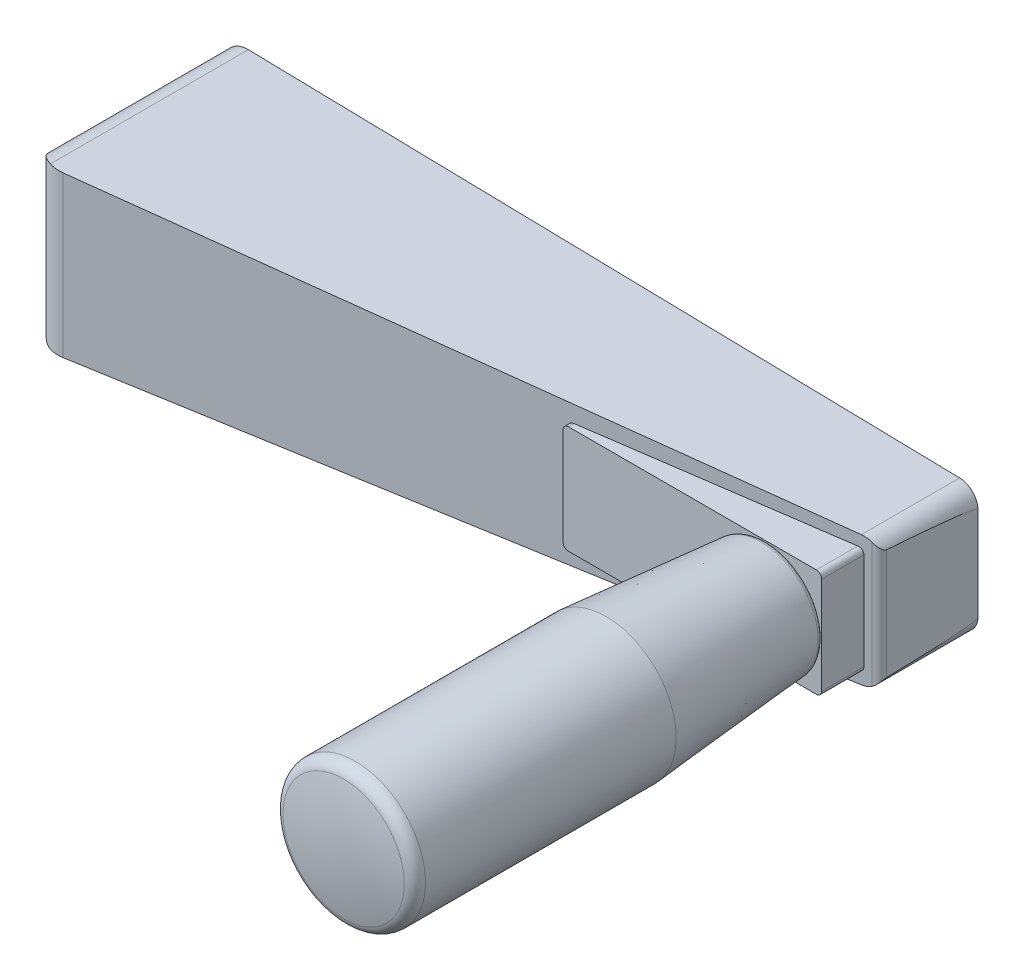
ISO-10303-21;
HEADER;
FILE_DESCRIPTION(('STEP AP214'),'2;1');
FILE_NAME('part.step','',(''),(''),'','','');
FILE_SCHEMA(('AUTOMOTIVE_DESIGN { 1 0 10303 214 1 1 1 1 }'));
ENDSEC;
DATA;
#1=APPLICATION_CONTEXT('core data for automotive mechanical design processes');
#2=APPLICATION_PROTOCOL_DEFINITION('international standard','automotive_design',2000,#1);
#3=PRODUCT_CONTEXT('',#1,'mechanical');
#4=PRODUCT('Part','Part','',(#3));
#5=PRODUCT_RELATED_PRODUCT_CATEGORY('part','',(#4));
#6=PRODUCT_DEFINITION_FORMATION('','',#4);
#7=PRODUCT_DEFINITION_CONTEXT('part definition',#1,'design');
#8=PRODUCT_DEFINITION('design','',#6,#7);
#9=PRODUCT_DEFINITION_SHAPE('','',#8);
#10=(LENGTH_UNIT() NAMED_UNIT(*) SI_UNIT(.MILLI.,.METRE.));
#11=(NAMED_UNIT(*) PLANE_ANGLE_UNIT() SI_UNIT($,.RADIAN.));
#12=(NAMED_UNIT(*) SI_UNIT($,.STERADIAN.) SOLID_ANGLE_UNIT());
#13=UNCERTAINTY_MEASURE_WITH_UNIT(LENGTH_MEASURE(1.E-05),#10,'distance_accuracy_value','');
#14=(GEOMETRIC_REPRESENTATION_CONTEXT(3) GLOBAL_UNCERTAINTY_ASSIGNED_CONTEXT((#13)) GLOBAL_UNIT_ASSIGNED_CONTEXT((#10,
#11,#12)) REPRESENTATION_CONTEXT('',''));
#15=CARTESIAN_POINT('',(0.,0.,0.));
#16=DIRECTION('',(0.,0.,1.));
#17=DIRECTION('',(1.,0.,0.));
#18=AXIS2_PLACEMENT_3D('',#15,#16,#17);
#19=CARTESIAN_POINT('',(70.,-15.,1.5));
#20=DIRECTION('',(0.,0.,-1.));
#21=DIRECTION('',(1.,0.,0.));
#22=AXIS2_PLACEMENT_3D('',#19,#20,#21);
#23=PLANE('',#22);
#24=DIRECTION('',(0.,1.,0.));
#25=VECTOR('',#24,1.);
#26=CARTESIAN_POINT('',(-70.,-15.,1.5000000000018));
#27=LINE('',#26,#25);
#28=CARTESIAN_POINT('',(-70.,-10.4025383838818,1.5000000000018));
#29=VERTEX_POINT('',#28);
#30=CARTESIAN_POINT('',(-70.,10.4025383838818,1.5000000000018));
#31=VERTEX_POINT('',#30);
#32=EDGE_CURVE('E282',#29,#31,#27,.T.);
#33=ORIENTED_EDGE('',*,*,#32,.T.);
#34=CARTESIAN_POINT('',(-65.5,10.4025383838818,1.5000000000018));
#35=DIRECTION('',(0.,0.,-1.));
#36=DIRECTION('',(1.,0.,0.));
#37=AXIS2_PLACEMENT_3D('',#34,#35,#36);
#38=CIRCLE('',#37,4.5);
#39=CARTESIAN_POINT('',(-65.4035935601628,14.9015055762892,1.5000000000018));
#40=VERTEX_POINT('',#39);
#41=EDGE_CURVE('E205',#31,#40,#38,.T.);
#42=ORIENTED_EDGE('',*,*,#41,.T.);
#43=DIRECTION('',(-0.999770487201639,0.0214236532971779,0.));
#44=VECTOR('',#43,1.);
#45=CARTESIAN_POINT('',(66.5860326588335,12.073156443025,1.5));
#46=LINE('',#45,#44);
#47=CARTESIAN_POINT('',(66.5860326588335,12.073156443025,1.5));
#48=VERTEX_POINT('',#47);
#49=EDGE_CURVE('E202',#48,#40,#46,.T.);
#50=ORIENTED_EDGE('',*,*,#49,.F.);
#51=CARTESIAN_POINT('',(66.5110498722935,8.57395973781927,1.5));
#52=DIRECTION('',(0.,0.,1.));
#53=DIRECTION('',(-1.,0.,0.));
#54=AXIS2_PLACEMENT_3D('',#51,#52,#53);
#55=CIRCLE('',#54,3.5);
#56=CARTESIAN_POINT('',(70.,8.85185721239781,1.5));
#57=VERTEX_POINT('',#56);
#58=EDGE_CURVE('E199',#57,#48,#55,.T.);
#59=ORIENTED_EDGE('',*,*,#58,.F.);
#60=DIRECTION('',(0.,1.,0.));
#61=VECTOR('',#60,1.);
#62=CARTESIAN_POINT('',(70.,-15.,1.5));
#63=LINE('',#62,#61);
#64=CARTESIAN_POINT('',(70.,-8.57419652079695,1.5));
#65=VERTEX_POINT('',#64);
#66=EDGE_CURVE('E279',#65,#57,#63,.T.);
#67=ORIENTED_EDGE('',*,*,#66,.F.);
#68=CARTESIAN_POINT('',(66.5,-8.57419652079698,1.5));
#69=DIRECTION('',(0.,0.,-1.));
#70=DIRECTION('',(1.,0.,0.));
#71=AXIS2_PLACEMENT_3D('',#68,#69,#70);
#72=CIRCLE('',#71,3.5);
#73=CARTESIAN_POINT('',(66.57498278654,-12.0733932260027,1.5));
#74=VERTEX_POINT('',#73);
#75=EDGE_CURVE('E407',#65,#74,#72,.T.);
#76=ORIENTED_EDGE('',*,*,#75,.T.);
#77=DIRECTION('',(-0.999770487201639,-0.0214236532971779,0.));
#78=VECTOR('',#77,1.);
#79=CARTESIAN_POINT('',(66.57498278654,-12.0733932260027,1.5));
#80=LINE('',#79,#78);
#81=CARTESIAN_POINT('',(-65.4035935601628,-14.9015055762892,1.5000000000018));
#82=VERTEX_POINT('',#81);
#83=EDGE_CURVE('E406',#74,#82,#80,.T.);
#84=ORIENTED_EDGE('',*,*,#83,.T.);
#85=CARTESIAN_POINT('',(-65.5,-10.4025383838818,1.5000000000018));
#86=DIRECTION('',(0.,0.,-1.));
#87=DIRECTION('',(1.,0.,0.));
#88=AXIS2_PLACEMENT_3D('',#85,#86,#87);
#89=CIRCLE('',#88,4.5);
#90=EDGE_CURVE('E255',#82,#29,#89,.T.);
#91=ORIENTED_EDGE('',*,*,#90,.T.);
#92=EDGE_LOOP('',(#33,#42,#50,#59,#67,#76,#84,#91));
#93=FACE_BOUND('',#92,.T.);
#94=CARTESIAN_POINT('',(0.,0.,1.5));
#95=DIRECTION('',(0.,0.,1.));
#96=DIRECTION('',(0.,-1.,0.));
#97=AXIS2_PLACEMENT_3D('',#94,#95,#96);
#98=CIRCLE('',#97,9.);
#99=CARTESIAN_POINT('',(0.,-9.,1.5));
#100=VERTEX_POINT('',#99);
#101=EDGE_CURVE('E657',#100,#100,#98,.T.);
#102=ORIENTED_EDGE('',*,*,#101,.T.);
#103=EDGE_LOOP('',(#102));
#104=FACE_BOUND('',#103,.T.);
#105=ADVANCED_FACE('F14',(#93,#104),#23,.T.);
#106=CARTESIAN_POINT('',(20.,-9.,27.5));
#107=DIRECTION('',(0.,0.,-1.));
#108=DIRECTION('',(1.,0.,0.));
#109=AXIS2_PLACEMENT_3D('',#106,#107,#108);
#110=PLANE('',#109);
#111=CARTESIAN_POINT('',(20.,-9.,27.5));
#112=DIRECTION('',(0.,0.,-1.));
#113=DIRECTION('',(1.,0.,0.));
#114=AXIS2_PLACEMENT_3D('',#111,#112,#113);
#115=CIRCLE('',#114,1.);
#116=CARTESIAN_POINT('',(20.,-10.,27.5));
#117=VERTEX_POINT('',#116);
#118=CARTESIAN_POINT('',(19.,-9.,27.500000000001));
#119=VERTEX_POINT('',#118);
#120=EDGE_CURVE('E152',#117,#119,#115,.T.);
#121=ORIENTED_EDGE('',*,*,#120,.F.);
#122=DIRECTION('',(1.,0.,0.));
#123=VECTOR('',#122,1.);
#124=CARTESIAN_POINT('',(20.,-10.,27.5));
#125=LINE('',#124,#123);
#126=CARTESIAN_POINT('',(66.,-10.,27.5));
#127=VERTEX_POINT('',#126);
#128=EDGE_CURVE('E149',#117,#127,#125,.T.);
#129=ORIENTED_EDGE('',*,*,#128,.T.);
#130=CARTESIAN_POINT('',(66.,-9.,27.5));
#131=DIRECTION('',(0.,0.,-1.));
#132=DIRECTION('',(1.,0.,0.));
#133=AXIS2_PLACEMENT_3D('',#130,#131,#132);
#134=CIRCLE('',#133,1.);
#135=CARTESIAN_POINT('',(67.,-9.,27.5));
#136=VERTEX_POINT('',#135);
#137=EDGE_CURVE('E178',#136,#127,#134,.T.);
#138=ORIENTED_EDGE('',*,*,#137,.F.);
#139=DIRECTION('',(0.,1.,0.));
#140=VECTOR('',#139,1.);
#141=CARTESIAN_POINT('',(67.,-9.,27.5));
#142=LINE('',#141,#140);
#143=CARTESIAN_POINT('',(67.,9.,27.5));
#144=VERTEX_POINT('',#143);
#145=EDGE_CURVE('E175',#136,#144,#142,.T.);
#146=ORIENTED_EDGE('',*,*,#145,.T.);
#147=CARTESIAN_POINT('',(66.,9.,27.5));
#148=DIRECTION('',(0.,0.,-1.));
#149=DIRECTION('',(1.,0.,0.));
#150=AXIS2_PLACEMENT_3D('',#147,#148,#149);
#151=CIRCLE('',#150,1.);
#152=CARTESIAN_POINT('',(66.,10.,27.5));
#153=VERTEX_POINT('',#152);
#154=EDGE_CURVE('E172',#153,#144,#151,.T.);
#155=ORIENTED_EDGE('',*,*,#154,.F.);
#156=DIRECTION('',(1.,0.,0.));
#157=VECTOR('',#156,1.);
#158=CARTESIAN_POINT('',(20.,10.,27.5));
#159=LINE('',#158,#157);
#160=CARTESIAN_POINT('',(20.,10.,27.5));
#161=VERTEX_POINT('',#160);
#162=EDGE_CURVE('E167',#161,#153,#159,.T.);
#163=ORIENTED_EDGE('',*,*,#162,.F.);
#164=CARTESIAN_POINT('',(20.,9.,27.5));
#165=DIRECTION('',(0.,0.,-1.));
#166=DIRECTION('',(1.,0.,0.));
#167=AXIS2_PLACEMENT_3D('',#164,#165,#166);
#168=CIRCLE('',#167,1.);
#169=CARTESIAN_POINT('',(19.,9.,27.500000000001));
#170=VERTEX_POINT('',#169);
#171=EDGE_CURVE('E165',#170,#161,#168,.T.);
#172=ORIENTED_EDGE('',*,*,#171,.F.);
#173=DIRECTION('',(0.,-1.,0.));
#174=VECTOR('',#173,1.);
#175=CARTESIAN_POINT('',(19.,9.,27.500000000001));
#176=LINE('',#175,#174);
#177=EDGE_CURVE('E144',#170,#119,#176,.T.);
#178=ORIENTED_EDGE('',*,*,#177,.T.);
#179=EDGE_LOOP('',(#121,#129,#138,#146,#155,#163,#172,#178));
#180=FACE_BOUND('',#179,.T.);
#181=CARTESIAN_POINT('',(57.,0.,27.5));
#182=DIRECTION('',(0.,0.,1.));
#183=DIRECTION('',(-1.,0.,0.));
#184=AXIS2_PLACEMENT_3D('',#181,#182,#183);
#185=CIRCLE('',#184,6.);
#186=CARTESIAN_POINT('',(51.,0.,27.5));
#187=VERTEX_POINT('',#186);
#188=EDGE_CURVE('E9',#187,#187,#185,.T.);
#189=ORIENTED_EDGE('',*,*,#188,.F.);
#190=EDGE_LOOP('',(#189));
#191=FACE_BOUND('',#190,.T.);
#192=ADVANCED_FACE('F161',(#180,#191),#110,.F.);
#193=CARTESIAN_POINT('',(-63.673258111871,-15.,33.));
#194=DIRECTION('',(0.,1.,0.));
#195=DIRECTION('',(-1.,0.,0.));
#196=AXIS2_PLACEMENT_3D('',#193,#194,#195);
#197=CYLINDRICAL_SURFACE('',#196,5.5);
#198=DIRECTION('',(0.,1.,0.));
#199=VECTOR('',#198,1.);
#200=CARTESIAN_POINT('',(-62.8864737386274,-15.,38.4434336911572));
#201=LINE('',#200,#199);
#202=CARTESIAN_POINT('',(-62.8864737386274,-14.8475672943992,38.4434336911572));
#203=VERTEX_POINT('',#202);
#204=CARTESIAN_POINT('',(-62.8864737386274,14.8475672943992,38.4434336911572));
#205=VERTEX_POINT('',#204);
#206=EDGE_CURVE('E288',#203,#205,#201,.T.);
#207=ORIENTED_EDGE('',*,*,#206,.T.);
#208=CARTESIAN_POINT('',(-63.673258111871,14.8644269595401,33.));
#209=DIRECTION('',(-0.0214236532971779,-0.999770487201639,0.));
#210=DIRECTION('',(-0.999770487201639,0.0214236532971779,0.));
#211=AXIS2_PLACEMENT_3D('',#208,#209,#210);
#212=ELLIPSE('',#211,5.50126261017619,5.5);
#213=CARTESIAN_POINT('',(-65.4035935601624,14.9015055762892,38.2207220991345));
#214=VERTEX_POINT('',#213);
#215=EDGE_CURVE('E394',#205,#214,#212,.T.);
#216=ORIENTED_EDGE('',*,*,#215,.T.);
#217=CARTESIAN_POINT('',(-69.173258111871,7.80308173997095,33.));
#218=CARTESIAN_POINT('',(-69.1732642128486,7.80309895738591,32.8817549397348));
#219=CARTESIAN_POINT('',(-69.1694357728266,7.79765738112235,32.7635520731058));
#220=CARTESIAN_POINT('',(-69.154276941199,7.77643170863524,32.5285233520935));
#221=CARTESIAN_POINT('',(-69.1429434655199,7.76064336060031,32.411698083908));
#222=CARTESIAN_POINT('',(-69.1130606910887,7.71992370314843,32.1800855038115));
#223=CARTESIAN_POINT('',(-69.0944789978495,7.69495137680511,32.0653097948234));
#224=CARTESIAN_POINT('',(-69.0505461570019,7.63759256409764,31.838931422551));
#225=CARTESIAN_POINT('',(-69.0251913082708,7.60520202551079,31.7273305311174));
#226=CARTESIAN_POINT('',(-68.9583941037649,7.52274808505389,31.4701235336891));
#227=CARTESIAN_POINT('',(-68.9144143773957,7.47042530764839,31.3259050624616));
#228=CARTESIAN_POINT('',(-68.8157742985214,7.35932214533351,31.0437579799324));
#229=CARTESIAN_POINT('',(-68.7611091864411,7.30053888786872,30.9058322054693));
#230=CARTESIAN_POINT('',(-68.6414603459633,7.17942101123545,30.6359403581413));
#231=CARTESIAN_POINT('',(-68.5764639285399,7.11708208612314,30.5039818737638));
#232=CARTESIAN_POINT('',(-68.436407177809,6.99132528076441,30.2461054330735));
#233=CARTESIAN_POINT('',(-68.3613486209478,6.92790759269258,30.1201864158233));
#234=CARTESIAN_POINT('',(-68.1977407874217,6.79927794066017,29.8691118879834));
#235=CARTESIAN_POINT('',(-68.1087496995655,6.73410633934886,29.7442228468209));
#236=CARTESIAN_POINT('',(-67.919789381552,6.60680304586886,29.5013357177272));
#237=CARTESIAN_POINT('',(-67.8198183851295,6.54467184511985,29.3833387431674));
#238=CARTESIAN_POINT('',(-67.6091211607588,6.42557916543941,29.1551310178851));
#239=CARTESIAN_POINT('',(-67.4984230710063,6.36860488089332,29.044901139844));
#240=CARTESIAN_POINT('',(-67.2662060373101,6.26165888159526,28.8328084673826));
#241=CARTESIAN_POINT('',(-67.1446882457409,6.21168642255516,28.7309447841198));
#242=CARTESIAN_POINT('',(-66.8394825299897,6.10235683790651,28.4971884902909));
#243=CARTESIAN_POINT('',(-66.6505562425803,6.04740301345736,28.3698547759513));
#244=CARTESIAN_POINT('',(-66.3534916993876,5.98305242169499,28.195879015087));
#245=CARTESIAN_POINT('',(-66.2521634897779,5.96461319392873,28.1407127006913));
#246=CARTESIAN_POINT('',(-66.045437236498,5.93449746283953,28.0365197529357));
#247=CARTESIAN_POINT('',(-65.9400409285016,5.92281810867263,27.9874905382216));
#248=CARTESIAN_POINT('',(-65.724909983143,5.90685665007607,27.8956362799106));
#249=CARTESIAN_POINT('',(-65.6151451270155,5.90264117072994,27.8528702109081));
#250=CARTESIAN_POINT('',(-65.3930720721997,5.90243934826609,27.7744760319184));
#251=CARTESIAN_POINT('',(-65.28076386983,5.90645301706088,27.7388479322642));
#252=CARTESIAN_POINT('',(-65.054758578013,5.92318673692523,27.6750365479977));
#253=CARTESIAN_POINT('',(-64.941062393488,5.93590138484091,27.6468486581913));
#254=CARTESIAN_POINT('',(-64.7134197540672,5.97032255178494,27.5979993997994));
#255=CARTESIAN_POINT('',(-64.5994733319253,5.99202795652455,27.5773370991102));
#256=CARTESIAN_POINT('',(-64.3871597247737,6.04112909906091,27.5456122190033));
#257=CARTESIAN_POINT('',(-64.288671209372,6.06743597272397,27.5336575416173));
#258=CARTESIAN_POINT('',(-64.0932175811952,6.12686303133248,27.5151779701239));
#259=CARTESIAN_POINT('',(-63.9962529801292,6.15998545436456,27.508654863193));
#260=CARTESIAN_POINT('',(-63.8046628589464,6.23284663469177,27.5007345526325));
#261=CARTESIAN_POINT('',(-63.710036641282,6.27258339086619,27.4993358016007));
#262=CARTESIAN_POINT('',(-63.5237460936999,6.35841192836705,27.501241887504));
#263=CARTESIAN_POINT('',(-63.4320829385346,6.40450619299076,27.5045485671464));
#264=CARTESIAN_POINT('',(-63.1627360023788,6.55170437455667,27.5208025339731));
#265=CARTESIAN_POINT('',(-62.9902733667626,6.66188447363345,27.5400705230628));
#266=CARTESIAN_POINT('',(-62.6631384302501,6.90344128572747,27.5910106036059));
#267=CARTESIAN_POINT('',(-62.508472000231,7.03482495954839,27.6226867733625));
#268=CARTESIAN_POINT('',(-62.199263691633,7.33533396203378,27.6984909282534));
#269=CARTESIAN_POINT('',(-62.0476230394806,7.50716316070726,27.7437286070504));
#270=CARTESIAN_POINT('',(-61.7722288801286,7.87154524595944,27.8369317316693));
#271=CARTESIAN_POINT('',(-61.6485054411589,8.06412015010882,27.8849000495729));
#272=CARTESIAN_POINT('',(-61.4789462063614,8.37827602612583,27.9562537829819));
#273=CARTESIAN_POINT('',(-61.4227299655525,8.49401202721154,27.9812047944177));
#274=CARTESIAN_POINT('',(-61.3202562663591,8.73032129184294,28.0284242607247));
#275=CARTESIAN_POINT('',(-61.2739948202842,8.8508925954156,28.0506937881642));
#276=CARTESIAN_POINT('',(-61.1918858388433,9.09607166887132,28.0913451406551));
#277=CARTESIAN_POINT('',(-61.1560306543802,9.22067639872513,28.1097298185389));
#278=CARTESIAN_POINT('',(-61.0951136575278,9.47311541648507,28.1415684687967));
#279=CARTESIAN_POINT('',(-61.0700504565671,9.60094928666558,28.1550230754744));
#280=CARTESIAN_POINT('',(-61.03224584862,9.85100863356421,28.1755323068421));
#281=CARTESIAN_POINT('',(-61.0188530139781,9.97310794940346,28.1829236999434));
#282=CARTESIAN_POINT('',(-61.0020997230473,10.2182015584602,28.1921932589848));
#283=CARTESIAN_POINT('',(-60.9987388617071,10.3411958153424,28.1940716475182));
#284=CARTESIAN_POINT('',(-61.0021030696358,10.5869827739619,28.1922003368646));
#285=CARTESIAN_POINT('',(-61.0088260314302,10.7097755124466,28.1884518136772));
#286=CARTESIAN_POINT('',(-61.0322403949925,10.954084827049,28.1755634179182));
#287=CARTESIAN_POINT('',(-61.0489315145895,11.0756014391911,28.1664236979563));
#288=CARTESIAN_POINT('',(-61.1096335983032,11.4143582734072,28.1338009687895));
#289=CARTESIAN_POINT('',(-61.1648231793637,11.6291590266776,28.1046976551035));
#290=CARTESIAN_POINT('',(-61.305286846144,12.0466279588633,28.0352484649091));
#291=CARTESIAN_POINT('',(-61.3905755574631,12.2492901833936,27.9948971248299));
#292=CARTESIAN_POINT('',(-61.5984200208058,12.657521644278,27.9049980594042));
#293=CARTESIAN_POINT('',(-61.7237210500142,12.8615803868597,27.8549427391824));
#294=CARTESIAN_POINT('',(-62.0055169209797,13.2478360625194,27.7568284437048));
#295=CARTESIAN_POINT('',(-62.1620345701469,13.4300168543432,27.7087709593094));
#296=CARTESIAN_POINT('',(-62.4246354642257,13.6902323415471,27.6427653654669));
#297=CARTESIAN_POINT('',(-62.5207317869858,13.7775788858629,27.6211461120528));
#298=CARTESIAN_POINT('',(-62.7206221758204,13.9439995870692,27.5821742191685));
#299=CARTESIAN_POINT('',(-62.8244126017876,14.0230776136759,27.5648195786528));
#300=CARTESIAN_POINT('',(-63.0389219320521,14.1721728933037,27.5356312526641));
#301=CARTESIAN_POINT('',(-63.1496350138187,14.2421976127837,27.5237929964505));
#302=CARTESIAN_POINT('',(-63.3771429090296,14.372506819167,27.506793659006));
#303=CARTESIAN_POINT('',(-63.4939364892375,14.4327932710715,27.5016312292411));
#304=CARTESIAN_POINT('',(-63.718598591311,14.5365556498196,27.4991761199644));
#305=CARTESIAN_POINT('',(-63.8259330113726,14.5811700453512,27.5010408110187));
#306=CARTESIAN_POINT('',(-64.0434462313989,14.6618693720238,27.5113928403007));
#307=CARTESIAN_POINT('',(-64.1536245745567,14.6979556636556,27.5198791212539));
#308=CARTESIAN_POINT('',(-64.3756489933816,14.7613403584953,27.5438927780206));
#309=CARTESIAN_POINT('',(-64.4874938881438,14.7886447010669,27.5594153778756));
#310=CARTESIAN_POINT('',(-64.711734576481,14.8344376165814,27.5977317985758));
#311=CARTESIAN_POINT('',(-64.8241303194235,14.8529269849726,27.6205249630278));
#312=CARTESIAN_POINT('',(-65.0336918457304,14.8793915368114,27.6699667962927));
#313=CARTESIAN_POINT('',(-65.1309362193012,14.8884218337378,27.6957277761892));
#314=CARTESIAN_POINT('',(-65.3242220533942,14.900147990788,27.7526683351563));
#315=CARTESIAN_POINT('',(-65.4202631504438,14.90284198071,27.783849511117));
#316=CARTESIAN_POINT('',(-65.7054882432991,14.9018527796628,27.8852540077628));
#317=CARTESIAN_POINT('',(-65.8919414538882,14.8891183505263,27.9633777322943));
#318=CARTESIAN_POINT('',(-66.2598240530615,14.8419593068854,28.1416919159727));
#319=CARTESIAN_POINT('',(-66.4407841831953,14.8067190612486,28.2426157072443));
#320=CARTESIAN_POINT('',(-66.7870715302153,14.7182578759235,28.4616946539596));
#321=CARTESIAN_POINT('',(-66.9523922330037,14.6650294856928,28.5798569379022));
#322=CARTESIAN_POINT('',(-67.348406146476,14.5133640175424,28.8967026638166));
#323=CARTESIAN_POINT('',(-67.5679324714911,14.4058556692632,29.1051230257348));
#324=CARTESIAN_POINT('',(-67.8666954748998,14.231660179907,29.4380475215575));
#325=CARTESIAN_POINT('',(-67.9613609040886,14.1712998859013,29.5526653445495));
#326=CARTESIAN_POINT('',(-68.1405612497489,14.0479788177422,29.788290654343));
#327=CARTESIAN_POINT('',(-68.2250976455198,13.9850184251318,29.9092972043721));
#328=CARTESIAN_POINT('',(-68.3860105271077,13.8567814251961,30.1604961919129));
#329=CARTESIAN_POINT('',(-68.4621310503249,13.7914862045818,30.2908424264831));
#330=CARTESIAN_POINT('',(-68.6037046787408,13.6623225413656,30.5579607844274));
#331=CARTESIAN_POINT('',(-68.6691542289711,13.5984545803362,30.694735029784));
#332=CARTESIAN_POINT('',(-68.7889550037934,13.4750211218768,30.9744813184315));
#333=CARTESIAN_POINT('',(-68.8433350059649,13.415444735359,31.117436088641));
#334=CARTESIAN_POINT('',(-68.9406450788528,13.3038195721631,31.4099066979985));
#335=CARTESIAN_POINT('',(-68.9835845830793,13.2517646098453,31.5594170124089));
#336=CARTESIAN_POINT('',(-69.0643612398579,13.1503298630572,31.8949405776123));
#337=CARTESIAN_POINT('',(-69.0995882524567,13.1034326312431,32.0824042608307));
#338=CARTESIAN_POINT('',(-69.1377400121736,13.0515565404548,32.3685731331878));
#339=CARTESIAN_POINT('',(-69.148005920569,13.0373482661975,32.4646842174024));
#340=CARTESIAN_POINT('',(-69.1634737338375,13.0158010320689,32.6580604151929));
#341=CARTESIAN_POINT('',(-69.1686780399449,13.00845881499,32.755324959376));
#342=CARTESIAN_POINT('',(-69.1739129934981,13.0010734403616,32.9508398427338));
#343=CARTESIAN_POINT('',(-69.1739133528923,13.0010730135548,33.0490926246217));
#344=CARTESIAN_POINT('',(-69.1686661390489,13.0084755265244,33.2451735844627));
#345=CARTESIAN_POINT('',(-69.163418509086,13.0158785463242,33.3430017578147));
#346=CARTESIAN_POINT('',(-69.1477872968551,13.0376522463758,33.5376698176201));
#347=CARTESIAN_POINT('',(-69.1373924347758,13.0520382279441,33.6345070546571));
#348=CARTESIAN_POINT('',(-69.1116761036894,13.0869869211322,33.8264354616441));
#349=CARTESIAN_POINT('',(-69.0963514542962,13.1075536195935,33.9215254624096));
#350=CARTESIAN_POINT('',(-69.054189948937,13.1628578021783,34.1459393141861));
#351=CARTESIAN_POINT('',(-69.025193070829,13.1999989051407,34.2742651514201));
#352=CARTESIAN_POINT('',(-68.9588489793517,13.2816222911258,34.526278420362));
#353=CARTESIAN_POINT('',(-68.9215006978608,13.3261055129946,34.6499652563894));
#354=CARTESIAN_POINT('',(-68.8388307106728,13.4201764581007,34.8929789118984));
#355=CARTESIAN_POINT('',(-68.7934905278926,13.4697758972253,35.0122948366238));
#356=CARTESIAN_POINT('',(-68.6952115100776,13.5720264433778,35.246351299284));
#357=CARTESIAN_POINT('',(-68.6422738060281,13.6246770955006,35.3610925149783));
#358=CARTESIAN_POINT('',(-68.5252102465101,13.7349527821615,35.5935678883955));
#359=CARTESIAN_POINT('',(-68.4605766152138,13.7926768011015,35.7109998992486));
#360=CARTESIAN_POINT('',(-68.3229236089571,13.9081323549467,35.9408434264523));
#361=CARTESIAN_POINT('',(-68.2499018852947,13.9658638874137,36.0532535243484));
#362=CARTESIAN_POINT('',(-68.0184313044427,14.1367301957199,36.3825159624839));
#363=CARTESIAN_POINT('',(-67.8473502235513,14.2477616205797,36.5918513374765));
#364=CARTESIAN_POINT('',(-67.4870203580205,14.4448705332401,36.9708663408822));
#365=CARTESIAN_POINT('',(-67.3004371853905,14.532251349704,37.1423930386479));
#366=CARTESIAN_POINT('',(-66.8996296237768,14.6846963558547,37.4616086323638));
#367=CARTESIAN_POINT('',(-66.6854353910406,14.7497846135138,37.609323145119));
#368=CARTESIAN_POINT('',(-66.2748071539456,14.8393318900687,37.8505139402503));
#369=CARTESIAN_POINT('',(-66.0825098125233,14.869104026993,37.9489678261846));
#370=CARTESIAN_POINT('',(-65.7850765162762,14.8946062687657,38.0795678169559));
#371=CARTESIAN_POINT('',(-65.6844132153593,14.8999135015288,38.1202607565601));
#372=CARTESIAN_POINT('',(-65.4807560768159,14.9036475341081,38.1956438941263));
#373=CARTESIAN_POINT('',(-65.3777632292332,14.9020772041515,38.2303365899));
#374=CARTESIAN_POINT('',(-65.1696732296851,14.8916138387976,38.2936412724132));
#375=CARTESIAN_POINT('',(-65.0645676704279,14.8826809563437,38.32221910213));
#376=CARTESIAN_POINT('',(-64.8537251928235,14.8571543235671,38.3729183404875));
#377=CARTESIAN_POINT('',(-64.7479882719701,14.8405605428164,38.3950397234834));
#378=CARTESIAN_POINT('',(-64.5368793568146,14.7995782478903,38.432831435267));
#379=CARTESIAN_POINT('',(-64.4315073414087,14.7751901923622,38.4485021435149));
#380=CARTESIAN_POINT('',(-64.2221169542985,14.7186448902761,38.4735612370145));
#381=CARTESIAN_POINT('',(-64.1180985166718,14.6864880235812,38.4829499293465));
#382=CARTESIAN_POINT('',(-63.9208603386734,14.61754848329,38.4952373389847));
#383=CARTESIAN_POINT('',(-63.8274586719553,14.5813678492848,38.4986083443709));
#384=CARTESIAN_POINT('',(-63.6432218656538,14.5028335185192,38.5006908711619));
#385=CARTESIAN_POINT('',(-63.552387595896,14.4604777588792,38.4994008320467));
#386=CARTESIAN_POINT('',(-63.284687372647,14.32457193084,38.4891547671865));
#387=CARTESIAN_POINT('',(-63.1124708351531,14.2221296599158,38.4738309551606));
#388=CARTESIAN_POINT('',(-62.7735575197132,13.9888554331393,38.4287882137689));
#389=CARTESIAN_POINT('',(-62.6079744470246,13.8565964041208,38.3981862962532));
#390=CARTESIAN_POINT('',(-62.2979592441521,13.57134649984,38.327649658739));
#391=CARTESIAN_POINT('',(-62.1535410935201,13.418342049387,38.2877088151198));
#392=CARTESIAN_POINT('',(-61.8674551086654,13.069563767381,38.1975843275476));
#393=CARTESIAN_POINT('',(-61.7295940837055,12.8708283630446,38.1467687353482));
#394=CARTESIAN_POINT('',(-61.4870131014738,12.4529646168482,38.0485170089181));
#395=CARTESIAN_POINT('',(-61.3823132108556,12.2338240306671,38.001082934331));
#396=CARTESIAN_POINT('',(-61.2496017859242,11.8860692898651,37.9374574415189));
#397=CARTESIAN_POINT('',(-61.2086248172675,11.7630477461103,37.9170292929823));
#398=CARTESIAN_POINT('',(-61.1373204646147,11.5133317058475,37.8806382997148));
#399=CARTESIAN_POINT('',(-61.1069880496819,11.3866389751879,37.864673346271));
#400=CARTESIAN_POINT('',(-61.0573902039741,11.1306843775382,37.8381842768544));
#401=CARTESIAN_POINT('',(-61.0381129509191,11.0014254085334,37.827654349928));
#402=CARTESIAN_POINT('',(-61.0108717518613,10.741374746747,37.8126858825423));
#403=CARTESIAN_POINT('',(-61.0029061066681,10.6105832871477,37.808246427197));
#404=CARTESIAN_POINT('',(-60.9986678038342,10.3634368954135,37.8058886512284));
#405=CARTESIAN_POINT('',(-61.0011845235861,10.2471071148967,37.8072951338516));
#406=CARTESIAN_POINT('',(-61.0152019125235,10.0151185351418,37.815059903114));
#407=CARTESIAN_POINT('',(-61.0267055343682,9.89945996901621,37.8214198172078));
#408=CARTESIAN_POINT('',(-61.0585557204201,9.66972315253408,37.838766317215));
#409=CARTESIAN_POINT('',(-61.0789020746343,9.55564486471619,37.8497527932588));
#410=CARTESIAN_POINT('',(-61.1281977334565,9.3298209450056,37.8758011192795));
#411=CARTESIAN_POINT('',(-61.1571505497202,9.21807628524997,37.8908646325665));
#412=CARTESIAN_POINT('',(-61.2548287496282,8.89297858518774,37.940291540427));
#413=CARTESIAN_POINT('',(-61.3352366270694,8.68373993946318,37.9794124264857));
#414=CARTESIAN_POINT('',(-61.5254264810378,8.28060836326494,38.0643479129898));
#415=CARTESIAN_POINT('',(-61.6352285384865,8.08672604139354,38.1101670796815));
#416=CARTESIAN_POINT('',(-61.8979251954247,7.69371235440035,38.2077078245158));
#417=CARTESIAN_POINT('',(-62.0545204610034,7.49703833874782,38.2594404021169));
#418=CARTESIAN_POINT('',(-62.3995836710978,7.13136882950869,38.3534740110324));
#419=CARTESIAN_POINT('',(-62.5880320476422,6.9623564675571,38.3957807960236));
#420=CARTESIAN_POINT('',(-62.9613788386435,6.68082971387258,38.4564753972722));
#421=CARTESIAN_POINT('',(-63.1422565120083,6.56361551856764,38.4775627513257));
#422=CARTESIAN_POINT('',(-63.4252957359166,6.40788592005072,38.4952246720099));
#423=CARTESIAN_POINT('',(-63.5216108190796,6.3593190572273,38.4987832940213));
#424=CARTESIAN_POINT('',(-63.717509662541,6.26921900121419,38.5006924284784));
#425=CARTESIAN_POINT('',(-63.8170920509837,6.22768289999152,38.4990450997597));
#426=CARTESIAN_POINT('',(-64.0192721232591,6.15175390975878,38.490042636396));
#427=CARTESIAN_POINT('',(-64.1218825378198,6.11739831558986,38.4826585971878));
#428=CARTESIAN_POINT('',(-64.3286989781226,6.05631324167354,38.4617938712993));
#429=CARTESIAN_POINT('',(-64.4329043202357,6.02958058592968,38.4483157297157));
#430=CARTESIAN_POINT('',(-64.6420019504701,5.98379474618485,38.4150478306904));
#431=CARTESIAN_POINT('',(-64.7468942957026,5.96474220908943,38.3952575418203));
#432=CARTESIAN_POINT('',(-64.9563820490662,5.93424070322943,38.349307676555));
#433=CARTESIAN_POINT('',(-65.0609774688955,5.92279143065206,38.3231483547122));
#434=CARTESIAN_POINT('',(-65.2610452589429,5.90785445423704,38.2667727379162));
#435=CARTESIAN_POINT('',(-65.3566073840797,5.90382830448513,38.2370152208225));
#436=CARTESIAN_POINT('',(-65.5460321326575,5.9017750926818,38.1723069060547));
#437=CARTESIAN_POINT('',(-65.6398941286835,5.90375020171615,38.1373542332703));
#438=CARTESIAN_POINT('',(-65.9180120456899,5.91816107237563,38.0250299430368));
#439=CARTESIAN_POINT('',(-66.0989272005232,5.93907384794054,37.9401561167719));
#440=CARTESIAN_POINT('',(-66.3878715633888,5.98945825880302,37.7851718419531));
#441=CARTESIAN_POINT('',(-66.4996181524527,6.01353472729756,37.7199811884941));
#442=CARTESIAN_POINT('',(-66.7170356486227,6.06878754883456,37.582786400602));
#443=CARTESIAN_POINT('',(-66.822704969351,6.09996574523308,37.5107805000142));
#444=CARTESIAN_POINT('',(-67.1301922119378,6.20263675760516,37.2853478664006));
#445=CARTESIAN_POINT('',(-67.3223001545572,6.28322975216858,37.1226090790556));
#446=CARTESIAN_POINT('',(-67.6178013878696,6.42986592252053,36.8363199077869));
#447=CARTESIAN_POINT('',(-67.7290867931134,6.49147904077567,36.718365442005));
#448=CARTESIAN_POINT('',(-67.9397673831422,6.61932708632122,36.4745957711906));
#449=CARTESIAN_POINT('',(-68.0391643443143,6.68556132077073,36.3487817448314));
#450=CARTESIAN_POINT('',(-68.2262370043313,6.82050532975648,36.089656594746));
#451=CARTESIAN_POINT('',(-68.3138937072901,6.88921889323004,35.956333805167));
#452=CARTESIAN_POINT('',(-68.4773137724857,7.02659695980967,35.682620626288));
#453=CARTESIAN_POINT('',(-68.5530809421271,7.09526147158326,35.5422325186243));
#454=CARTESIAN_POINT('',(-68.6754722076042,7.21322465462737,35.289630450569));
#455=CARTESIAN_POINT('',(-68.7246847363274,7.26313977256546,35.178959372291));
#456=CARTESIAN_POINT('',(-68.8160940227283,7.35984889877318,34.9534747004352));
#457=CARTESIAN_POINT('',(-68.8582902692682,7.40664267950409,34.8386608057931));
#458=CARTESIAN_POINT('',(-68.9737150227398,7.53950750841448,34.4884083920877));
#459=CARTESIAN_POINT('',(-69.0362133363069,7.61850330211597,34.2462749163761));
#460=CARTESIAN_POINT('',(-69.1119771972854,7.71811772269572,33.835043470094));
#461=CARTESIAN_POINT('',(-69.1348342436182,7.74949999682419,33.6703395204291));
#462=CARTESIAN_POINT('',(-69.1654554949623,7.79194973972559,33.3370562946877));
#463=CARTESIAN_POINT('',(-69.1732494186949,7.80305720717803,33.1684853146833));
#464=CARTESIAN_POINT('',(-69.173258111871,7.80308173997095,33.));
#465=B_SPLINE_CURVE_WITH_KNOTS('',3,(#217,#218,#219,#220,#221,#222,#223,#224,#225,#226,#227,
#228,#229,#230,#231,#232,#233,#234,#235,#236,#237,#238,#239,#240,#241,#242,#243,#244,#245,#246,
#247,#248,#249,#250,#251,#252,#253,#254,#255,#256,#257,#258,#259,#260,#261,#262,#263,#264,#265,
#266,#267,#268,#269,#270,#271,#272,#273,#274,#275,#276,#277,#278,#279,#280,#281,#282,#283,#284,
#285,#286,#287,#288,#289,#290,#291,#292,#293,#294,#295,#296,#297,#298,#299,#300,#301,#302,#303,
#304,#305,#306,#307,#308,#309,#310,#311,#312,#313,#314,#315,#316,#317,#318,#319,#320,#321,#322,
#323,#324,#325,#326,#327,#328,#329,#330,#331,#332,#333,#334,#335,#336,#337,#338,#339,#340,#341,
#342,#343,#344,#345,#346,#347,#348,#349,#350,#351,#352,#353,#354,#355,#356,#357,#358,#359,#360,
#361,#362,#363,#364,#365,#366,#367,#368,#369,#370,#371,#372,#373,#374,#375,#376,#377,#378,#379,
#380,#381,#382,#383,#384,#385,#386,#387,#388,#389,#390,#391,#392,#393,#394,#395,#396,#397,#398,
#399,#400,#401,#402,#403,#404,#405,#406,#407,#408,#409,#410,#411,#412,#413,#414,#415,#416,#417,
#418,#419,#420,#421,#422,#423,#424,#425,#426,#427,#428,#429,#430,#431,#432,#433,#434,#435,#436,
#437,#438,#439,#440,#441,#442,#443,#444,#445,#446,#447,#448,#449,#450,#451,#452,#453,#454,#455,
#456,#457,#458,#459,#460,#461,#462,#463,#464),.UNSPECIFIED.,.T.,.F.,(4,2,2,2,2,2,2,2,2,2,2,2,2,
2,2,2,2,2,2,2,2,2,2,2,2,2,2,2,2,2,2,2,2,2,2,2,2,2,2,2,2,2,2,2,2,2,2,2,2,2,2,2,2,2,2,2,2,2,2,2,2,
2,2,2,2,2,2,2,2,2,2,2,2,2,2,2,2,2,2,2,2,2,2,2,2,2,2,2,2,2,2,2,2,2,2,2,2,2,2,2,2,2,2,2,2,2,2,2,2,
2,2,2,2,2,2,2,2,2,2,2,2,2,2,4),(0.,0.354484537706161,0.709114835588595,1.06534858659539,
1.42177739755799,1.89980216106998,2.37804033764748,2.85687049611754,3.33561622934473,
3.83498163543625,4.33442748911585,4.83259699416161,5.33071350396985,6.03068504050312,
6.38084895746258,6.7308650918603,7.08399013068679,7.43711568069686,7.79002214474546,
8.14288488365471,8.45042820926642,8.75807268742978,9.06562425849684,9.37329630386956,
9.98730253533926,10.6015107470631,11.2995937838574,11.9984251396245,12.3911971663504,
12.7838115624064,13.1761366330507,13.5684112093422,13.937050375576,14.3056746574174,
14.6742219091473,15.0427587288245,15.710713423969,16.3789931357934,17.1099586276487,
17.8414601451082,18.2359429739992,18.630240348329,19.0242104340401,19.4181009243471,
19.766347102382,20.1145376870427,20.4624922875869,20.8104154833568,21.1130635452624,
21.415800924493,22.0207625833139,22.6489987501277,23.277495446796,24.2354931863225,
24.7165048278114,25.1974461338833,25.6903771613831,26.1834720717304,26.6752682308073,
27.1666576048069,27.7534715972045,28.0462412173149,28.3388718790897,28.6332057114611,
28.9275427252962,29.2225276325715,29.5177032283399,29.9271491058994,30.3366473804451,
30.7471051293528,31.1575018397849,31.5949802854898,32.032581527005,32.906139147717,
33.7075839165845,34.5081606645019,35.1594454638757,35.4852179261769,35.8108544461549,
36.1382650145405,36.4656768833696,36.7930694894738,37.1204460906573,37.420763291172,
37.7211810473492,38.3215346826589,38.961495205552,39.6018765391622,40.3403088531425,
41.0791871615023,41.4725160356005,41.865658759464,42.2583802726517,42.6510427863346,
42.9996902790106,43.3484523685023,43.6972061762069,44.0461024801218,44.7257960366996,
45.4059551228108,46.172445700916,46.9384671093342,47.5851493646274,47.9085847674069,
48.231886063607,48.5568269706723,48.8816322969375,49.2064649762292,49.53128467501,
49.8314442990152,50.1317125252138,50.7318557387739,51.1261731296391,51.5205929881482,
52.3100797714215,52.829959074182,53.3497605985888,53.8703932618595,54.3908588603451,
54.7835704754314,55.1763106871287,55.9585775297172,56.4646758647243,56.969774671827),.UNSPECIFIED.);
#466=CARTESIAN_POINT('',(-69.1713733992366,13.0046562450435,33.1439732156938));
#467=VERTEX_POINT('',#466);
#468=EDGE_CURVE('E248',#467,#214,#465,.T.);
#469=ORIENTED_EDGE('',*,*,#468,.F.);
#470=DIRECTION('',(0.,1.,0.));
#471=VECTOR('',#470,1.);
#472=CARTESIAN_POINT('',(-69.1713733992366,-15.,33.1439732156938));
#473=LINE('',#472,#471);
#474=CARTESIAN_POINT('',(-69.1713733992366,-13.0046562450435,33.1439732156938));
#475=VERTEX_POINT('',#474);
#476=EDGE_CURVE('E285',#475,#467,#473,.T.);
#477=ORIENTED_EDGE('',*,*,#476,.F.);
#478=CARTESIAN_POINT('',(-69.173258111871,-13.0019950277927,33.));
#479=CARTESIAN_POINT('',(-69.1732642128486,-13.0019778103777,32.8817549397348));
#480=CARTESIAN_POINT('',(-69.1694357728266,-13.0074193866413,32.7635520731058));
#481=CARTESIAN_POINT('',(-69.154276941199,-13.0286450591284,32.5285233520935));
#482=CARTESIAN_POINT('',(-69.1429434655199,-13.0444334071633,32.411698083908));
#483=CARTESIAN_POINT('',(-69.1130606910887,-13.0851530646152,32.1800855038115));
#484=CARTESIAN_POINT('',(-69.0944789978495,-13.1101253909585,32.0653097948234));
#485=CARTESIAN_POINT('',(-69.0505461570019,-13.167484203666,31.838931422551));
#486=CARTESIAN_POINT('',(-69.0251913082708,-13.1998747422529,31.7273305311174));
#487=CARTESIAN_POINT('',(-68.9583941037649,-13.2823286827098,31.4701235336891));
#488=CARTESIAN_POINT('',(-68.9144143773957,-13.3346514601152,31.3259050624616));
#489=CARTESIAN_POINT('',(-68.8157742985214,-13.4457546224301,31.0437579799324));
#490=CARTESIAN_POINT('',(-68.7611091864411,-13.5045378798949,30.9058322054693));
#491=CARTESIAN_POINT('',(-68.6414603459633,-13.6256557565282,30.6359403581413));
#492=CARTESIAN_POINT('',(-68.5764639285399,-13.6879946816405,30.5039818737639));
#493=CARTESIAN_POINT('',(-68.436407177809,-13.8137514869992,30.2461054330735));
#494=CARTESIAN_POINT('',(-68.3613486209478,-13.8771691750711,30.1201864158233));
#495=CARTESIAN_POINT('',(-68.1977407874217,-14.0057988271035,29.8691118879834));
#496=CARTESIAN_POINT('',(-68.1087496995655,-14.0709704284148,29.7442228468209));
#497=CARTESIAN_POINT('',(-67.919789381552,-14.1982737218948,29.5013357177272));
#498=CARTESIAN_POINT('',(-67.8198183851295,-14.2604049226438,29.3833387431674));
#499=CARTESIAN_POINT('',(-67.6091211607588,-14.3794976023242,29.1551310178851));
#500=CARTESIAN_POINT('',(-67.4984230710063,-14.4364718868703,29.044901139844));
#501=CARTESIAN_POINT('',(-67.2662060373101,-14.5434178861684,28.8328084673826));
#502=CARTESIAN_POINT('',(-67.1446882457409,-14.5933903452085,28.7309447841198));
#503=CARTESIAN_POINT('',(-66.8394825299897,-14.7027199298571,28.4971884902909));
#504=CARTESIAN_POINT('',(-66.6505562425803,-14.7576737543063,28.3698547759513));
#505=CARTESIAN_POINT('',(-66.3534916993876,-14.8220243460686,28.195879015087));
#506=CARTESIAN_POINT('',(-66.2521634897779,-14.8404635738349,28.1407127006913));
#507=CARTESIAN_POINT('',(-66.0454372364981,-14.8705793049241,28.0365197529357));
#508=CARTESIAN_POINT('',(-65.9400409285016,-14.882258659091,27.9874905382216));
#509=CARTESIAN_POINT('',(-65.724909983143,-14.8982201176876,27.8956362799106));
#510=CARTESIAN_POINT('',(-65.6151451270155,-14.9024355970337,27.8528702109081));
#511=CARTESIAN_POINT('',(-65.3930720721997,-14.9026374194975,27.7744760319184));
#512=CARTESIAN_POINT('',(-65.28076386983,-14.8986237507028,27.7388479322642));
#513=CARTESIAN_POINT('',(-65.054758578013,-14.8818900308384,27.6750365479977));
#514=CARTESIAN_POINT('',(-64.941062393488,-14.8691753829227,27.6468486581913));
#515=CARTESIAN_POINT('',(-64.7134197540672,-14.8347542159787,27.5979993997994));
#516=CARTESIAN_POINT('',(-64.5994733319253,-14.8130488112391,27.5773370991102));
#517=CARTESIAN_POINT('',(-64.3871597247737,-14.7639476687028,27.5456122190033));
#518=CARTESIAN_POINT('',(-64.288671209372,-14.7376407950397,27.5336575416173));
#519=CARTESIAN_POINT('',(-64.0932175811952,-14.6782137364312,27.5151779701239));
#520=CARTESIAN_POINT('',(-63.9962529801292,-14.6450913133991,27.508654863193));
#521=CARTESIAN_POINT('',(-63.8046628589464,-14.5722301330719,27.5007345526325));
#522=CARTESIAN_POINT('',(-63.7100366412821,-14.5324933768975,27.4993358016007));
#523=CARTESIAN_POINT('',(-63.5237460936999,-14.4466648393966,27.501241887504));
#524=CARTESIAN_POINT('',(-63.4320829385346,-14.4005705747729,27.5045485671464));
#525=CARTESIAN_POINT('',(-63.1627360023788,-14.253372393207,27.5208025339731));
#526=CARTESIAN_POINT('',(-62.9902733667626,-14.1431922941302,27.5400705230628));
#527=CARTESIAN_POINT('',(-62.6631384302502,-13.9016354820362,27.5910106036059));
#528=CARTESIAN_POINT('',(-62.508472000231,-13.7702518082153,27.6226867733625));
#529=CARTESIAN_POINT('',(-62.199263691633,-13.4697428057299,27.6984909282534));
#530=CARTESIAN_POINT('',(-62.0476230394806,-13.2979136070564,27.7437286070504));
#531=CARTESIAN_POINT('',(-61.7722288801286,-12.9335315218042,27.8369317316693));
#532=CARTESIAN_POINT('',(-61.6485054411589,-12.7409566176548,27.8849000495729));
#533=CARTESIAN_POINT('',(-61.4789462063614,-12.4268007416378,27.9562537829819));
#534=CARTESIAN_POINT('',(-61.4227299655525,-12.3110647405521,27.9812047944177));
#535=CARTESIAN_POINT('',(-61.3202562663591,-12.0747554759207,28.0284242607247));
#536=CARTESIAN_POINT('',(-61.2739948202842,-11.954184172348,28.0506937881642));
#537=CARTESIAN_POINT('',(-61.1918858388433,-11.7090050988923,28.0913451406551));
#538=CARTESIAN_POINT('',(-61.1560306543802,-11.5844003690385,28.1097298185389));
#539=CARTESIAN_POINT('',(-61.0951136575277,-11.3319613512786,28.1415684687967));
#540=CARTESIAN_POINT('',(-61.0700504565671,-11.2041274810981,28.1550230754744));
#541=CARTESIAN_POINT('',(-61.03224584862,-10.9540681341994,28.1755323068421));
#542=CARTESIAN_POINT('',(-61.0188530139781,-10.8319688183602,28.1829236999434));
#543=CARTESIAN_POINT('',(-61.0020997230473,-10.5868752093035,28.1921932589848));
#544=CARTESIAN_POINT('',(-60.9987388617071,-10.4638809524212,28.1940716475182));
#545=CARTESIAN_POINT('',(-61.0021030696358,-10.2180939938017,28.1922003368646));
#546=CARTESIAN_POINT('',(-61.0088260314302,-10.095301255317,28.1884518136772));
#547=CARTESIAN_POINT('',(-61.0322403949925,-9.85099194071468,28.1755634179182));
#548=CARTESIAN_POINT('',(-61.0489315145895,-9.72947532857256,28.1664236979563));
#549=CARTESIAN_POINT('',(-61.1096335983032,-9.39071849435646,28.1338009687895));
#550=CARTESIAN_POINT('',(-61.1648231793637,-9.17591774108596,28.1046976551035));
#551=CARTESIAN_POINT('',(-61.3052868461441,-8.75844880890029,28.0352484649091));
#552=CARTESIAN_POINT('',(-61.3905755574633,-8.55578658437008,27.9948971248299));
#553=CARTESIAN_POINT('',(-61.598420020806,-8.14755512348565,27.9049980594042));
#554=CARTESIAN_POINT('',(-61.7237210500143,-7.9434963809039,27.8549427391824));
#555=CARTESIAN_POINT('',(-62.0055169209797,-7.55724070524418,27.7568284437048));
#556=CARTESIAN_POINT('',(-62.1620345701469,-7.3750599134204,27.7087709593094));
#557=CARTESIAN_POINT('',(-62.4246354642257,-7.1148444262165,27.6427653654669));
#558=CARTESIAN_POINT('',(-62.5207317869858,-7.02749788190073,27.6211461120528));
#559=CARTESIAN_POINT('',(-62.7206221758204,-6.86107718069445,27.5821742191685));
#560=CARTESIAN_POINT('',(-62.8244126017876,-6.78199915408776,27.5648195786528));
#561=CARTESIAN_POINT('',(-63.0389219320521,-6.63290387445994,27.5356312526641));
#562=CARTESIAN_POINT('',(-63.1496350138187,-6.56287915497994,27.5237929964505));
#563=CARTESIAN_POINT('',(-63.3771429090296,-6.43256994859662,27.506793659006));
#564=CARTESIAN_POINT('',(-63.4939364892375,-6.37228349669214,27.5016312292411));
#565=CARTESIAN_POINT('',(-63.718598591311,-6.26852111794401,27.4991761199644));
#566=CARTESIAN_POINT('',(-63.8259330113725,-6.22390672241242,27.5010408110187));
#567=CARTESIAN_POINT('',(-64.0434462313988,-6.14320739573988,27.5113928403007));
#568=CARTESIAN_POINT('',(-64.1536245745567,-6.10712110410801,27.5198791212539));
#569=CARTESIAN_POINT('',(-64.3756489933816,-6.04373640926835,27.5438927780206));
#570=CARTESIAN_POINT('',(-64.4874938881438,-6.01643206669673,27.5594153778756));
#571=CARTESIAN_POINT('',(-64.711734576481,-5.9706391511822,27.5977317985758));
#572=CARTESIAN_POINT('',(-64.8241303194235,-5.95214978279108,27.6205249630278));
#573=CARTESIAN_POINT('',(-65.0336918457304,-5.92568523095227,27.6699667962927));
#574=CARTESIAN_POINT('',(-65.1309362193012,-5.91665493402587,27.6957277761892));
#575=CARTESIAN_POINT('',(-65.3242220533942,-5.9049287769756,27.7526683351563));
#576=CARTESIAN_POINT('',(-65.4202631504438,-5.90223478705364,27.783849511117));
#577=CARTESIAN_POINT('',(-65.7054882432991,-5.90322398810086,27.8852540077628));
#578=CARTESIAN_POINT('',(-65.8919414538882,-5.91595841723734,27.9633777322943));
#579=CARTESIAN_POINT('',(-66.2598240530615,-5.96311746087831,28.1416919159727));
#580=CARTESIAN_POINT('',(-66.4407841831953,-5.99835770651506,28.2426157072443));
#581=CARTESIAN_POINT('',(-66.7870715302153,-6.08681889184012,28.4616946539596));
#582=CARTESIAN_POINT('',(-66.9523922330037,-6.14004728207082,28.5798569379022));
#583=CARTESIAN_POINT('',(-67.348406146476,-6.29171275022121,28.8967026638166));
#584=CARTESIAN_POINT('',(-67.5679324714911,-6.3992210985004,29.1051230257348));
#585=CARTESIAN_POINT('',(-67.8666954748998,-6.57341658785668,29.4380475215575));
#586=CARTESIAN_POINT('',(-67.9613609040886,-6.63377688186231,29.5526653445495));
#587=CARTESIAN_POINT('',(-68.1405612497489,-6.75709795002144,29.788290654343));
#588=CARTESIAN_POINT('',(-68.2250976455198,-6.82005834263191,29.9092972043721));
#589=CARTESIAN_POINT('',(-68.3860105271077,-6.94829534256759,30.1604961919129));
#590=CARTESIAN_POINT('',(-68.4621310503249,-7.01359056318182,30.2908424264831));
#591=CARTESIAN_POINT('',(-68.6037046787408,-7.14275422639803,30.5579607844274));
#592=CARTESIAN_POINT('',(-68.6691542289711,-7.20662218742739,30.694735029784));
#593=CARTESIAN_POINT('',(-68.7889550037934,-7.33005564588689,30.9744813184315));
#594=CARTESIAN_POINT('',(-68.8433350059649,-7.38963203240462,31.117436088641));
#595=CARTESIAN_POINT('',(-68.9406450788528,-7.50125719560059,31.4099066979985));
#596=CARTESIAN_POINT('',(-68.9835845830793,-7.55331215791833,31.5594170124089));
#597=CARTESIAN_POINT('',(-69.0643612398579,-7.65474690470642,31.8949405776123));
#598=CARTESIAN_POINT('',(-69.0995882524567,-7.70164413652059,32.0824042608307));
#599=CARTESIAN_POINT('',(-69.1377400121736,-7.7535202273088,32.3685731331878));
#600=CARTESIAN_POINT('',(-69.148005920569,-7.76772850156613,32.4646842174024));
#601=CARTESIAN_POINT('',(-69.1634737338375,-7.78927573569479,32.6580604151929));
#602=CARTESIAN_POINT('',(-69.1686780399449,-7.7966179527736,32.755324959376));
#603=CARTESIAN_POINT('',(-69.1739129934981,-7.80400332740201,32.9508398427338));
#604=CARTESIAN_POINT('',(-69.1739133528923,-7.80400375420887,33.0490926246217));
#605=CARTESIAN_POINT('',(-69.1686661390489,-7.79660124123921,33.2451735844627));
#606=CARTESIAN_POINT('',(-69.163418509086,-7.78919822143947,33.3430017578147));
#607=CARTESIAN_POINT('',(-69.1477872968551,-7.76742452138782,33.5376698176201));
#608=CARTESIAN_POINT('',(-69.1373924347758,-7.75303853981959,33.6345070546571));
#609=CARTESIAN_POINT('',(-69.1116761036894,-7.71808984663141,33.8264354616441));
#610=CARTESIAN_POINT('',(-69.0963514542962,-7.69752314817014,33.9215254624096));
#611=CARTESIAN_POINT('',(-69.054189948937,-7.6422189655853,34.1459393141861));
#612=CARTESIAN_POINT('',(-69.025193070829,-7.60507786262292,34.2742651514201));
#613=CARTESIAN_POINT('',(-68.9588489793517,-7.52345447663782,34.526278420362));
#614=CARTESIAN_POINT('',(-68.9215006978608,-7.47897125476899,34.6499652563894));
#615=CARTESIAN_POINT('',(-68.8388307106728,-7.38490030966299,34.8929789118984));
#616=CARTESIAN_POINT('',(-68.7934905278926,-7.33530087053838,35.0122948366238));
#617=CARTESIAN_POINT('',(-68.6952115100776,-7.2330503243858,35.246351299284));
#618=CARTESIAN_POINT('',(-68.6422738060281,-7.18039967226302,35.3610925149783));
#619=CARTESIAN_POINT('',(-68.5252102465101,-7.07012398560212,35.5935678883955));
#620=CARTESIAN_POINT('',(-68.4605766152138,-7.01239996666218,35.7109998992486));
#621=CARTESIAN_POINT('',(-68.322923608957,-6.89694441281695,35.9408434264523));
#622=CARTESIAN_POINT('',(-68.2499018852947,-6.83921288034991,36.0532535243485));
#623=CARTESIAN_POINT('',(-68.0184313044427,-6.6683465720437,36.3825159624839));
#624=CARTESIAN_POINT('',(-67.8473502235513,-6.55731514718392,36.5918513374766));
#625=CARTESIAN_POINT('',(-67.4870203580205,-6.3602062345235,36.9708663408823));
#626=CARTESIAN_POINT('',(-67.3004371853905,-6.27282541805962,37.142393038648));
#627=CARTESIAN_POINT('',(-66.8996296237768,-6.12038041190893,37.4616086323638));
#628=CARTESIAN_POINT('',(-66.6854353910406,-6.05529215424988,37.6093231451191));
#629=CARTESIAN_POINT('',(-66.2748071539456,-5.96574487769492,37.8505139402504));
#630=CARTESIAN_POINT('',(-66.0825098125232,-5.93597274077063,37.9489678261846));
#631=CARTESIAN_POINT('',(-65.7850765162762,-5.91047049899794,38.0795678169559));
#632=CARTESIAN_POINT('',(-65.6844132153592,-5.90516326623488,38.1202607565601));
#633=CARTESIAN_POINT('',(-65.4807560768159,-5.90142923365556,38.1956438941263));
#634=CARTESIAN_POINT('',(-65.3777632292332,-5.90299956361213,38.2303365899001));
#635=CARTESIAN_POINT('',(-65.1696732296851,-5.91346292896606,38.2936412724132));
#636=CARTESIAN_POINT('',(-65.0645676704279,-5.92239581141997,38.32221910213));
#637=CARTESIAN_POINT('',(-64.8537251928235,-5.94792244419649,38.3729183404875));
#638=CARTESIAN_POINT('',(-64.7479882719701,-5.96451622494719,38.3950397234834));
#639=CARTESIAN_POINT('',(-64.5368793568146,-6.00549851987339,38.432831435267));
#640=CARTESIAN_POINT('',(-64.4315073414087,-6.02988657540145,38.4485021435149));
#641=CARTESIAN_POINT('',(-64.2221169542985,-6.08643187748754,38.4735612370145));
#642=CARTESIAN_POINT('',(-64.1180985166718,-6.11858874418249,38.4829499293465));
#643=CARTESIAN_POINT('',(-63.9208603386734,-6.18752828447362,38.4952373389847));
#644=CARTESIAN_POINT('',(-63.8274586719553,-6.22370891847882,38.4986083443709));
#645=CARTESIAN_POINT('',(-63.6432218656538,-6.3022432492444,38.5006908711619));
#646=CARTESIAN_POINT('',(-63.552387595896,-6.34459900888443,38.4994008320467));
#647=CARTESIAN_POINT('',(-63.284687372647,-6.48050483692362,38.4891547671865));
#648=CARTESIAN_POINT('',(-63.1124708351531,-6.58294710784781,38.4738309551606));
#649=CARTESIAN_POINT('',(-62.7735575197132,-6.81622133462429,38.4287882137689));
#650=CARTESIAN_POINT('',(-62.6079744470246,-6.94848036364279,38.3981862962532));
#651=CARTESIAN_POINT('',(-62.2979592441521,-7.23373026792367,38.327649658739));
#652=CARTESIAN_POINT('',(-62.1535410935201,-7.38673471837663,38.2877088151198));
#653=CARTESIAN_POINT('',(-61.8674551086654,-7.73551300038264,38.1975843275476));
#654=CARTESIAN_POINT('',(-61.7295940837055,-7.93424840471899,38.1467687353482));
#655=CARTESIAN_POINT('',(-61.487013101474,-8.35211215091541,38.0485170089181));
#656=CARTESIAN_POINT('',(-61.3823132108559,-8.5712527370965,38.001082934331));
#657=CARTESIAN_POINT('',(-61.2496017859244,-8.91900747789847,37.9374574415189));
#658=CARTESIAN_POINT('',(-61.2086248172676,-9.0420290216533,37.9170292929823));
#659=CARTESIAN_POINT('',(-61.1373204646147,-9.29174506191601,37.8806382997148));
#660=CARTESIAN_POINT('',(-61.1069880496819,-9.41843779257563,37.864673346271));
#661=CARTESIAN_POINT('',(-61.0573902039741,-9.67439239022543,37.8381842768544));
#662=CARTESIAN_POINT('',(-61.0381129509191,-9.80365135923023,37.827654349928));
#663=CARTESIAN_POINT('',(-61.0108717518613,-10.0637020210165,37.8126858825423));
#664=CARTESIAN_POINT('',(-61.0029061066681,-10.1944934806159,37.808246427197));
#665=CARTESIAN_POINT('',(-60.9986678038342,-10.4416398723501,37.8058886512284));
#666=CARTESIAN_POINT('',(-61.0011845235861,-10.5579696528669,37.8072951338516));
#667=CARTESIAN_POINT('',(-61.0152019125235,-10.7899582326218,37.815059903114));
#668=CARTESIAN_POINT('',(-61.0267055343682,-10.9056167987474,37.8214198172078));
#669=CARTESIAN_POINT('',(-61.0585557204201,-11.1353536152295,37.838766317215));
#670=CARTESIAN_POINT('',(-61.0789020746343,-11.2494319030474,37.8497527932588));
#671=CARTESIAN_POINT('',(-61.1281977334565,-11.475255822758,37.8758011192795));
#672=CARTESIAN_POINT('',(-61.1571505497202,-11.5870004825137,37.8908646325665));
#673=CARTESIAN_POINT('',(-61.2548287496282,-11.9120981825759,37.940291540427));
#674=CARTESIAN_POINT('',(-61.3352366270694,-12.1213368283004,37.9794124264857));
#675=CARTESIAN_POINT('',(-61.5254264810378,-12.5244684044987,38.0643479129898));
#676=CARTESIAN_POINT('',(-61.6352285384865,-12.7183507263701,38.1101670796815));
#677=CARTESIAN_POINT('',(-61.8979251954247,-13.1113644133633,38.2077078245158));
#678=CARTESIAN_POINT('',(-62.0545204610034,-13.3080384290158,38.2594404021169));
#679=CARTESIAN_POINT('',(-62.3995836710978,-13.6737079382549,38.3534740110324));
#680=CARTESIAN_POINT('',(-62.5880320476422,-13.8427203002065,38.3957807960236));
#681=CARTESIAN_POINT('',(-62.9613788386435,-14.1242470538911,38.4564753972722));
#682=CARTESIAN_POINT('',(-63.1422565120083,-14.241461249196,38.4775627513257));
#683=CARTESIAN_POINT('',(-63.4252957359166,-14.3971908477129,38.4952246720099));
#684=CARTESIAN_POINT('',(-63.5216108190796,-14.4457577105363,38.4987832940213));
#685=CARTESIAN_POINT('',(-63.717509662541,-14.5358577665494,38.5006924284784));
#686=CARTESIAN_POINT('',(-63.8170920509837,-14.5773938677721,38.4990450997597));
#687=CARTESIAN_POINT('',(-64.0192721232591,-14.6533228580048,38.490042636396));
#688=CARTESIAN_POINT('',(-64.1218825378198,-14.6876784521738,38.4826585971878));
#689=CARTESIAN_POINT('',(-64.3286989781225,-14.7487635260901,38.4617938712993));
#690=CARTESIAN_POINT('',(-64.4329043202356,-14.7754961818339,38.4483157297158));
#691=CARTESIAN_POINT('',(-64.64200195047,-14.8212820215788,38.4150478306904));
#692=CARTESIAN_POINT('',(-64.7468942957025,-14.8403345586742,38.3952575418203));
#693=CARTESIAN_POINT('',(-64.9563820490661,-14.8708360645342,38.3493076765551));
#694=CARTESIAN_POINT('',(-65.0609774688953,-14.8822853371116,38.3231483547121));
#695=CARTESIAN_POINT('',(-65.2610452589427,-14.8972223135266,38.2667727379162));
#696=CARTESIAN_POINT('',(-65.3566073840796,-14.9012484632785,38.2370152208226));
#697=CARTESIAN_POINT('',(-65.5460321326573,-14.9033016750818,38.1723069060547));
#698=CARTESIAN_POINT('',(-65.6398941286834,-14.9013265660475,38.1373542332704));
#699=CARTESIAN_POINT('',(-65.9180120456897,-14.886915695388,38.0250299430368));
#700=CARTESIAN_POINT('',(-66.098927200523,-14.8660029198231,37.9401561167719));
#701=CARTESIAN_POINT('',(-66.3878715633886,-14.8156185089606,37.7851718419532));
#702=CARTESIAN_POINT('',(-66.4996181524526,-14.7915420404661,37.7199811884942));
#703=CARTESIAN_POINT('',(-66.7170356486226,-14.7362892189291,37.5827864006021));
#704=CARTESIAN_POINT('',(-66.8227049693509,-14.7051110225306,37.5107805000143));
#705=CARTESIAN_POINT('',(-67.1301922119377,-14.6024400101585,37.2853478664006));
#706=CARTESIAN_POINT('',(-67.322300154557,-14.5218470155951,37.1226090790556));
#707=CARTESIAN_POINT('',(-67.6178013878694,-14.3752108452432,36.8363199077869));
#708=CARTESIAN_POINT('',(-67.7290867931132,-14.313597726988,36.7183654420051));
#709=CARTESIAN_POINT('',(-67.9397673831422,-14.1857496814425,36.4745957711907));
#710=CARTESIAN_POINT('',(-68.0391643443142,-14.119515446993,36.3487817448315));
#711=CARTESIAN_POINT('',(-68.2262370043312,-13.9845714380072,36.0896565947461));
#712=CARTESIAN_POINT('',(-68.31389370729,-13.9158578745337,35.9563338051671));
#713=CARTESIAN_POINT('',(-68.4773137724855,-13.778479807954,35.6826206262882));
#714=CARTESIAN_POINT('',(-68.5530809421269,-13.7098152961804,35.5422325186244));
#715=CARTESIAN_POINT('',(-68.675472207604,-13.5918521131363,35.2896304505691));
#716=CARTESIAN_POINT('',(-68.7246847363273,-13.5419369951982,35.1789593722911));
#717=CARTESIAN_POINT('',(-68.8160940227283,-13.4452278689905,34.9534747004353));
#718=CARTESIAN_POINT('',(-68.8582902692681,-13.3984340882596,34.8386608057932));
#719=CARTESIAN_POINT('',(-68.9737150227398,-13.2655692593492,34.4884083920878));
#720=CARTESIAN_POINT('',(-69.0362133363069,-13.1865734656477,34.2462749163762));
#721=CARTESIAN_POINT('',(-69.1119771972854,-13.0869590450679,33.835043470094));
#722=CARTESIAN_POINT('',(-69.1348342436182,-13.0555767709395,33.6703395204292));
#723=CARTESIAN_POINT('',(-69.1654554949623,-13.0131270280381,33.3370562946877));
#724=CARTESIAN_POINT('',(-69.1732494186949,-13.0020195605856,33.1684853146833));
#725=CARTESIAN_POINT('',(-69.173258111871,-13.0019950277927,33.));
#726=B_SPLINE_CURVE_WITH_KNOTS('',3,(#478,#479,#480,#481,#482,#483,#484,#485,#486,#487,#488,
#489,#490,#491,#492,#493,#494,#495,#496,#497,#498,#499,#500,#501,#502,#503,#504,#505,#506,#507,
#508,#509,#510,#511,#512,#513,#514,#515,#516,#517,#518,#519,#520,#521,#522,#523,#524,#525,#526,
#527,#528,#529,#530,#531,#532,#533,#534,#535,#536,#537,#538,#539,#540,#541,#542,#543,#544,#545,
#546,#547,#548,#549,#550,#551,#552,#553,#554,#555,#556,#557,#558,#559,#560,#561,#562,#563,#564,
#565,#566,#567,#568,#569,#570,#571,#572,#573,#574,#575,#576,#577,#578,#579,#580,#581,#582,#583,
#584,#585,#586,#587,#588,#589,#590,#591,#592,#593,#594,#595,#596,#597,#598,#599,#600,#601,#602,
#603,#604,#605,#606,#607,#608,#609,#610,#611,#612,#613,#614,#615,#616,#617,#618,#619,#620,#621,
#622,#623,#624,#625,#626,#627,#628,#629,#630,#631,#632,#633,#634,#635,#636,#637,#638,#639,#640,
#641,#642,#643,#644,#645,#646,#647,#648,#649,#650,#651,#652,#653,#654,#655,#656,#657,#658,#659,
#660,#661,#662,#663,#664,#665,#666,#667,#668,#669,#670,#671,#672,#673,#674,#675,#676,#677,#678,
#679,#680,#681,#682,#683,#684,#685,#686,#687,#688,#689,#690,#691,#692,#693,#694,#695,#696,#697,
#698,#699,#700,#701,#702,#703,#704,#705,#706,#707,#708,#709,#710,#711,#712,#713,#714,#715,#716,
#717,#718,#719,#720,#721,#722,#723,#724,#725),.UNSPECIFIED.,.T.,.F.,(4,2,2,2,2,2,2,2,2,2,2,2,2,
2,2,2,2,2,2,2,2,2,2,2,2,2,2,2,2,2,2,2,2,2,2,2,2,2,2,2,2,2,2,2,2,2,2,2,2,2,2,2,2,2,2,2,2,2,2,2,2,
2,2,2,2,2,2,2,2,2,2,2,2,2,2,2,2,2,2,2,2,2,2,2,2,2,2,2,2,2,2,2,2,2,2,2,2,2,2,2,2,2,2,2,2,2,2,2,2,
2,2,2,2,2,2,2,2,2,2,2,2,2,2,4),(0.,0.354484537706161,0.709114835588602,1.0653485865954,
1.42177739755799,1.89980216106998,2.37804033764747,2.85687049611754,3.33561622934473,
3.83498163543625,4.33442748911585,4.83259699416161,5.33071350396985,6.03068504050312,
6.38084895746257,6.73086509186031,7.08399013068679,7.43711568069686,7.79002214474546,
8.1428848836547,8.45042820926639,8.75807268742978,9.06562425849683,9.37329630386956,
9.98730253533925,10.6015107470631,11.2995937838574,11.9984251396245,12.3911971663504,
12.7838115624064,13.1761366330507,13.5684112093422,13.937050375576,14.3056746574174,
14.6742219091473,15.0427587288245,15.710713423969,16.3789931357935,17.1099586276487,
17.8414601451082,18.2359429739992,18.630240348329,19.0242104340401,19.4181009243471,
19.7663471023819,20.1145376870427,20.4624922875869,20.8104154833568,21.1130635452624,
21.415800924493,22.0207625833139,22.6489987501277,23.277495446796,24.2354931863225,
24.7165048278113,25.1974461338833,25.6903771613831,26.1834720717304,26.6752682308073,
27.1666576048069,27.7534715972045,28.0462412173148,28.3388718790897,28.6332057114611,
28.9275427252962,29.2225276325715,29.5177032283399,29.9271491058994,30.336647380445,
30.7471051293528,31.1575018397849,31.5949802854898,32.032581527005,32.9061391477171,
33.7075839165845,34.508160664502,35.1594454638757,35.4852179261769,35.8108544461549,
36.1382650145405,36.4656768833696,36.7930694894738,37.1204460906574,37.420763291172,
37.7211810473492,38.3215346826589,38.961495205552,39.6018765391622,40.3403088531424,
41.0791871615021,41.4725160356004,41.8656587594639,42.2583802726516,42.6510427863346,
42.9996902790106,43.3484523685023,43.6972061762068,44.0461024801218,44.7257960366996,
45.4059551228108,46.172445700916,46.9384671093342,47.5851493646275,47.9085847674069,
48.231886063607,48.5568269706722,48.8816322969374,49.2064649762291,49.5312846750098,
49.8314442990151,50.1317125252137,50.7318557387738,51.1261731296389,51.520592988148,
52.3100797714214,52.8299590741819,53.3497605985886,53.8703932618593,54.3908588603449,
54.7835704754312,55.1763106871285,55.958577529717,56.4646758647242,56.969774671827),.UNSPECIFIED.);
#727=CARTESIAN_POINT('',(-65.4035935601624,-14.9015055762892,38.2207220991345));
#728=VERTEX_POINT('',#727);
#729=EDGE_CURVE('E268',#728,#475,#726,.T.);
#730=ORIENTED_EDGE('',*,*,#729,.F.);
#731=CARTESIAN_POINT('',(-63.673258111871,-14.8644269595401,33.));
#732=DIRECTION('',(0.0214236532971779,-0.999770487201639,0.));
#733=DIRECTION('',(0.999770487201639,0.0214236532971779,0.));
#734=AXIS2_PLACEMENT_3D('',#731,#732,#733);
#735=ELLIPSE('',#734,5.50126261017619,5.5);
#736=EDGE_CURVE('E366',#203,#728,#735,.T.);
#737=ORIENTED_EDGE('',*,*,#736,.F.);
#738=EDGE_LOOP('',(#207,#216,#469,#477,#730,#737));
#739=FACE_BOUND('',#738,.T.);
#740=ADVANCED_FACE('F259',(#739),#197,.T.);
#741=CARTESIAN_POINT('',(-70.,-15.,1.5000000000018));
#742=DIRECTION('',(-0.999657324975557,0.,0.0261769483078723));
#743=DIRECTION('',(-0.0261769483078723,0.,-0.999657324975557));
#744=AXIS2_PLACEMENT_3D('',#741,#742,#743);
#745=PLANE('',#744);
#746=ORIENTED_EDGE('',*,*,#476,.T.);
#747=CARTESIAN_POINT('',(-65.4999999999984,10.4025383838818,173.348066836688));
#748=DIRECTION('',(-0.999657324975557,0.,0.0261769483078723));
#749=DIRECTION('',(-0.0261769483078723,0.,-0.999657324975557));
#750=AXIS2_PLACEMENT_3D('',#747,#748,#749);
#751=ELLIPSE('',#750,171.906975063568,4.5);
#752=EDGE_CURVE('E256',#467,#31,#751,.T.);
#753=ORIENTED_EDGE('',*,*,#752,.T.);
#754=ORIENTED_EDGE('',*,*,#32,.F.);
#755=CARTESIAN_POINT('',(-65.4999999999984,-10.4025383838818,173.348066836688));
#756=DIRECTION('',(-0.999657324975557,0.,0.0261769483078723));
#757=DIRECTION('',(-0.0261769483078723,0.,-0.999657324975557));
#758=AXIS2_PLACEMENT_3D('',#755,#756,#757);
#759=ELLIPSE('',#758,171.906975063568,4.5);
#760=EDGE_CURVE('E275',#29,#475,#759,.T.);
#761=ORIENTED_EDGE('',*,*,#760,.T.);
#762=EDGE_LOOP('',(#746,#753,#754,#761));
#763=FACE_BOUND('',#762,.T.);
#764=ADVANCED_FACE('F263',(#763),#745,.T.);
#765=CARTESIAN_POINT('',(68.067418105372,-15.,18.));
#766=DIRECTION('',(0.,1.,0.));
#767=DIRECTION('',(-1.,0.,0.));
#768=AXIS2_PLACEMENT_3D('',#765,#766,#767);
#769=CYLINDRICAL_SURFACE('',#768,1.5);
#770=DIRECTION('',(0.,1.,0.));
#771=VECTOR('',#770,1.);
#772=CARTESIAN_POINT('',(69.5669040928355,-15.,18.0392654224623));
#773=LINE('',#772,#771);
#774=CARTESIAN_POINT('',(69.5669040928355,-10.2606422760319,18.0392654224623));
#775=VERTEX_POINT('',#774);
#776=CARTESIAN_POINT('',(69.5669040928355,10.2803462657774,18.0392654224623));
#777=VERTEX_POINT('',#776);
#778=EDGE_CURVE('E274',#775,#777,#773,.T.);
#779=ORIENTED_EDGE('',*,*,#778,.T.);
#780=CARTESIAN_POINT('',(66.567418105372,12.0735057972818,18.));
#781=CARTESIAN_POINT('',(66.5674245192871,12.0735095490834,17.9160499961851));
#782=CARTESIAN_POINT('',(66.5744966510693,12.073414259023,17.831969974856));
#783=CARTESIAN_POINT('',(66.6026379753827,12.0727881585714,17.6660325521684));
#784=CARTESIAN_POINT('',(66.6237433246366,12.0722562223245,17.5841814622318));
#785=CARTESIAN_POINT('',(66.6793585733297,12.0700208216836,17.4252223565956));
#786=CARTESIAN_POINT('',(66.7138596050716,12.0683181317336,17.348111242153));
#787=CARTESIAN_POINT('',(66.7952324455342,12.0626406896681,17.2008658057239));
#788=CARTESIAN_POINT('',(66.8420965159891,12.0586673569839,17.130727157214));
#789=CARTESIAN_POINT('',(66.9462974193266,12.047182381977,16.999992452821));
#790=CARTESIAN_POINT('',(67.0035435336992,12.0397005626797,16.9393216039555));
#791=CARTESIAN_POINT('',(67.1268186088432,12.0199303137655,16.828620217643));
#792=CARTESIAN_POINT('',(67.192845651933,12.0076429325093,16.7785873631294));
#793=CARTESIAN_POINT('',(67.3291784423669,11.977690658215,16.6918192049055));
#794=CARTESIAN_POINT('',(67.3992983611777,11.9601966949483,16.6547324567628));
#795=CARTESIAN_POINT('',(67.5429731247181,11.9192115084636,16.5924890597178));
#796=CARTESIAN_POINT('',(67.6165276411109,11.8957208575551,16.5673312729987));
#797=CARTESIAN_POINT('',(67.7643273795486,11.8428187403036,16.5289620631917));
#798=CARTESIAN_POINT('',(67.8385700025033,11.8134245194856,16.515716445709));
#799=CARTESIAN_POINT('',(67.9857825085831,11.7491172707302,16.500393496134));
#800=CARTESIAN_POINT('',(68.0587519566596,11.7142023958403,16.498319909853));
#801=CARTESIAN_POINT('',(68.2079744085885,11.6363332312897,16.5045741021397));
#802=CARTESIAN_POINT('',(68.2839585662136,11.5929433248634,16.5138250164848));
#803=CARTESIAN_POINT('',(68.430998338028,11.501639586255,16.5427993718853));
#804=CARTESIAN_POINT('',(68.5020519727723,11.4537239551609,16.5625269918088));
#805=CARTESIAN_POINT('',(68.6687242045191,11.332446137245,16.6218265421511));
#806=CARTESIAN_POINT('',(68.7612498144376,11.2572282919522,16.6663198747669));
#807=CARTESIAN_POINT('',(68.933560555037,11.1027709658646,16.7711655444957));
#808=CARTESIAN_POINT('',(69.0132977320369,11.0235177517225,16.8315754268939));
#809=CARTESIAN_POINT('',(69.1233058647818,10.9040079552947,16.9333983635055));
#810=CARTESIAN_POINT('',(69.1586092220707,10.863754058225,16.9695299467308));
#811=CARTESIAN_POINT('',(69.2256708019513,10.7838345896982,17.0455260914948));
#812=CARTESIAN_POINT('',(69.2574306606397,10.7441687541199,17.0853889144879));
#813=CARTESIAN_POINT('',(69.3171576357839,10.6663638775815,17.1688706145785));
#814=CARTESIAN_POINT('',(69.3451392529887,10.6282194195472,17.2124740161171));
#815=CARTESIAN_POINT('',(69.397162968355,10.5544594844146,17.3039084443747));
#816=CARTESIAN_POINT('',(69.421210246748,10.5188407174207,17.3517337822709));
#817=CARTESIAN_POINT('',(69.4610422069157,10.4577415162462,17.4433605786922));
#818=CARTESIAN_POINT('',(69.4775362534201,10.4315796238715,17.4863911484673));
#819=CARTESIAN_POINT('',(69.5070248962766,10.3836350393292,17.5760227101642));
#820=CARTESIAN_POINT('',(69.5200197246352,10.361852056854,17.6226234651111));
#821=CARTESIAN_POINT('',(69.5419339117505,10.324451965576,17.7201216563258));
#822=CARTESIAN_POINT('',(69.5507875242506,10.3089348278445,17.7710741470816));
#823=CARTESIAN_POINT('',(69.5631572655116,10.2870890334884,17.8754966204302));
#824=CARTESIAN_POINT('',(69.5666903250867,10.2807312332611,17.9289580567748));
#825=CARTESIAN_POINT('',(69.5678554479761,10.2786403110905,18.028660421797));
#826=CARTESIAN_POINT('',(69.5662424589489,10.2815478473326,18.0748674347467));
#827=CARTESIAN_POINT('',(69.5589136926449,10.2945931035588,18.1659367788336));
#828=CARTESIAN_POINT('',(69.5531913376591,10.3047424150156,18.2107968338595));
#829=CARTESIAN_POINT('',(69.5359965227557,10.3346605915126,18.3107132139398));
#830=CARTESIAN_POINT('',(69.5233401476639,10.3563619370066,18.3649690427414));
#831=CARTESIAN_POINT('',(69.4932504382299,10.4062607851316,18.4689924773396));
#832=CARTESIAN_POINT('',(69.4758036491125,10.4344765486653,18.518746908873));
#833=CARTESIAN_POINT('',(69.4395873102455,10.4908945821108,18.6075587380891));
#834=CARTESIAN_POINT('',(69.4213134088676,10.5185855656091,18.6471538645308));
#835=CARTESIAN_POINT('',(69.3821164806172,10.5760061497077,18.7234692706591));
#836=CARTESIAN_POINT('',(69.3611915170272,10.6057372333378,18.7601874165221));
#837=CARTESIAN_POINT('',(69.294711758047,10.6968960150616,18.8664624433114));
#838=CARTESIAN_POINT('',(69.2454741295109,10.7602537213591,18.9320879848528));
#839=CARTESIAN_POINT('',(69.1335425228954,10.8936056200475,19.058815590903));
#840=CARTESIAN_POINT('',(69.0700743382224,10.9637166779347,19.1191001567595));
#841=CARTESIAN_POINT('',(68.9328570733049,11.1026696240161,19.2282856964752));
#842=CARTESIAN_POINT('',(68.8591158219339,11.1715124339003,19.2771952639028));
#843=CARTESIAN_POINT('',(68.7031640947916,11.3043304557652,19.3614421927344));
#844=CARTESIAN_POINT('',(68.621146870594,11.3683744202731,19.397025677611));
#845=CARTESIAN_POINT('',(68.4483082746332,11.4908421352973,19.4536737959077));
#846=CARTESIAN_POINT('',(68.3574952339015,11.5492711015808,19.4747520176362));
#847=CARTESIAN_POINT('',(68.1858416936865,11.6485460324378,19.4973543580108));
#848=CARTESIAN_POINT('',(68.1061171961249,11.6906685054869,19.5016986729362));
#849=CARTESIAN_POINT('',(67.9439237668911,11.7684768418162,19.4971027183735));
#850=CARTESIAN_POINT('',(67.8614565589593,11.804166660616,19.4881706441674));
#851=CARTESIAN_POINT('',(67.696006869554,11.8684697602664,19.4557452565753));
#852=CARTESIAN_POINT('',(67.6130241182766,11.8970417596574,19.4321696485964));
#853=CARTESIAN_POINT('',(67.4504647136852,11.9466025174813,19.3700107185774));
#854=CARTESIAN_POINT('',(67.3708871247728,11.9675933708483,19.3314315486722));
#855=CARTESIAN_POINT('',(67.2261772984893,12.0008495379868,19.2444820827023));
#856=CARTESIAN_POINT('',(67.1603933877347,12.0137671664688,19.1974373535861));
#857=CARTESIAN_POINT('',(67.0368513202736,12.0348069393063,19.0929205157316));
#858=CARTESIAN_POINT('',(66.9790917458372,12.042929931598,19.0354502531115));
#859=CARTESIAN_POINT('',(66.874146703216,12.0554721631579,18.9124492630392));
#860=CARTESIAN_POINT('',(66.8268408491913,12.0599353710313,18.8470254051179));
#861=CARTESIAN_POINT('',(66.7432683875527,12.0665001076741,18.7093086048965));
#862=CARTESIAN_POINT('',(66.7070093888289,12.0686000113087,18.6370109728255));
#863=CARTESIAN_POINT('',(66.6456287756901,12.0715112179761,18.4852102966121));
#864=CARTESIAN_POINT('',(66.6208861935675,12.07228066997,18.4055535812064));
#865=CARTESIAN_POINT('',(66.5849755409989,12.0732263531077,18.2433752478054));
#866=CARTESIAN_POINT('',(66.5737745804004,12.0734040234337,18.1608610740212));
#867=CARTESIAN_POINT('',(66.5680946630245,12.0734939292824,18.0520948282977));
#868=CARTESIAN_POINT('',(66.5674161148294,12.0735046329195,18.0260536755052));
#869=CARTESIAN_POINT('',(66.567418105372,12.0735057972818,18.));
#870=B_SPLINE_CURVE_WITH_KNOTS('',3,(#780,#781,#782,#783,#784,#785,#786,#787,#788,#789,#790,
#791,#792,#793,#794,#795,#796,#797,#798,#799,#800,#801,#802,#803,#804,#805,#806,#807,#808,#809,
#810,#811,#812,#813,#814,#815,#816,#817,#818,#819,#820,#821,#822,#823,#824,#825,#826,#827,#828,
#829,#830,#831,#832,#833,#834,#835,#836,#837,#838,#839,#840,#841,#842,#843,#844,#845,#846,#847,
#848,#849,#850,#851,#852,#853,#854,#855,#856,#857,#858,#859,#860,#861,#862,#863,#864,#865,#866,
#867,#868,#869),.UNSPECIFIED.,.T.,.F.,(4,2,2,2,2,2,2,2,2,2,2,2,2,2,2,2,2,2,2,2,2,2,2,2,2,2,2,2,
2,2,2,2,2,2,2,2,2,2,2,2,2,2,2,2,4),(0.,0.251780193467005,0.504211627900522,0.756476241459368,
1.00858333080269,1.25858524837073,1.50853265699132,1.75104111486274,1.99352643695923,
2.23531345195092,2.47718152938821,2.74014880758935,3.00322105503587,3.38304684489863,
3.76426517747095,3.95787836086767,4.15140177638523,4.34415995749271,4.53666226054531,
4.69531943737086,4.85396609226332,5.0150524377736,5.1756250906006,5.31378110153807,
5.45215874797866,5.6305315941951,5.80941065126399,5.96416749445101,6.11903805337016,
6.42897703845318,6.76443847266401,7.09964564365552,7.42831445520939,7.75667495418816,
8.02638519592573,8.29592901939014,8.56700152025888,8.83799905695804,9.08250880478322,
9.32697529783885,9.5684598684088,9.81011039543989,10.0592327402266,10.3077487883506,
10.38588814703),.UNSPECIFIED.);
#871=CARTESIAN_POINT('',(68.2819736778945,11.5928716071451,19.4845760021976));
#872=VERTEX_POINT('',#871);
#873=EDGE_CURVE('E212',#777,#872,#870,.T.);
#874=ORIENTED_EDGE('',*,*,#873,.T.);
#875=DIRECTION('',(0.,1.,0.));
#876=VECTOR('',#875,1.);
#877=CARTESIAN_POINT('',(68.2819736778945,-15.,19.4845760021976));
#878=LINE('',#877,#876);
#879=CARTESIAN_POINT('',(68.2819736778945,-11.5865991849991,19.4845760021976));
#880=VERTEX_POINT('',#879);
#881=EDGE_CURVE('E291',#880,#872,#878,.T.);
#882=ORIENTED_EDGE('',*,*,#881,.F.);
#883=CARTESIAN_POINT('',(66.567418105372,-12.0735471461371,18.));
#884=CARTESIAN_POINT('',(66.5674181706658,-12.0735471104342,17.9158814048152));
#885=CARTESIAN_POINT('',(66.5745107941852,-12.073432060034,17.8317630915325));
#886=CARTESIAN_POINT('',(66.6026811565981,-12.0727179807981,17.6659019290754));
#887=CARTESIAN_POINT('',(66.6237590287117,-12.0721189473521,17.5841591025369));
#888=CARTESIAN_POINT('',(66.6793088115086,-12.0697102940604,17.4253420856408));
#889=CARTESIAN_POINT('',(66.7137852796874,-12.0679002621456,17.348269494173));
#890=CARTESIAN_POINT('',(66.7951185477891,-12.0619694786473,17.2010482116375));
#891=CARTESIAN_POINT('',(66.8419748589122,-12.0578488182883,17.1308992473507));
#892=CARTESIAN_POINT('',(66.9461353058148,-12.0460372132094,17.0001766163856));
#893=CARTESIAN_POINT('',(67.0033445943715,-12.0383777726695,16.9395246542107));
#894=CARTESIAN_POINT('',(67.1265205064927,-12.0182281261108,16.8288636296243));
#895=CARTESIAN_POINT('',(67.1924842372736,-12.0057395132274,16.7788510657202));
#896=CARTESIAN_POINT('',(67.3286823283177,-11.9753731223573,16.6921024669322));
#897=CARTESIAN_POINT('',(67.3987328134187,-11.9576655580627,16.6550176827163));
#898=CARTESIAN_POINT('',(67.5422479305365,-11.9162455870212,16.5927633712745));
#899=CARTESIAN_POINT('',(67.6157123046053,-11.8925336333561,16.567592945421));
#900=CARTESIAN_POINT('',(67.7633751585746,-11.8391673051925,16.5291599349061));
#901=CARTESIAN_POINT('',(67.8375718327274,-11.809525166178,16.5158731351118));
#902=CARTESIAN_POINT('',(67.9846767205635,-11.7447177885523,16.5004564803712));
#903=CARTESIAN_POINT('',(68.0575844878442,-11.7095506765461,16.4983304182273));
#904=CARTESIAN_POINT('',(68.2067561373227,-11.6311061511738,16.5044593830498));
#905=CARTESIAN_POINT('',(68.2827461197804,-11.5873864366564,16.5136496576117));
#906=CARTESIAN_POINT('',(68.4297785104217,-11.4954114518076,16.5424963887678));
#907=CARTESIAN_POINT('',(68.5008189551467,-11.4471543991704,16.5621569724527));
#908=CARTESIAN_POINT('',(68.6677523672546,-11.3247992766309,16.6213827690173));
#909=CARTESIAN_POINT('',(68.7605077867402,-11.2488158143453,16.6659200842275));
#910=CARTESIAN_POINT('',(68.9331889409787,-11.0927661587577,16.7708877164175));
#911=CARTESIAN_POINT('',(69.0130659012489,-11.012685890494,16.8313762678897));
#912=CARTESIAN_POINT('',(69.1232460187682,-10.8918736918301,16.933335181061));
#913=CARTESIAN_POINT('',(69.1586056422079,-10.8511649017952,16.9695224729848));
#914=CARTESIAN_POINT('',(69.2257638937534,-10.7703215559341,17.0456350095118));
#915=CARTESIAN_POINT('',(69.2575641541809,-10.7301867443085,17.0855585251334));
#916=CARTESIAN_POINT('',(69.3173585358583,-10.6514363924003,17.169168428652));
#917=CARTESIAN_POINT('',(69.3453674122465,-10.612815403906,17.2128390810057));
#918=CARTESIAN_POINT('',(69.3974388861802,-10.5380988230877,17.304429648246));
#919=CARTESIAN_POINT('',(69.4215067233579,-10.501999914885,17.35234378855));
#920=CARTESIAN_POINT('',(69.4611330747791,-10.4404153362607,17.4436290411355));
#921=CARTESIAN_POINT('',(69.477441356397,-10.4142064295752,17.486178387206));
#922=CARTESIAN_POINT('',(69.5066506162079,-10.3660791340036,17.5748106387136));
#923=CARTESIAN_POINT('',(69.5195515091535,-10.3441608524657,17.6208936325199));
#924=CARTESIAN_POINT('',(69.5413856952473,-10.3063801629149,17.7173410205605));
#925=CARTESIAN_POINT('',(69.5502548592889,-10.2906161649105,17.7677603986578));
#926=CARTESIAN_POINT('',(69.5627730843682,-10.2681858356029,17.8711659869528));
#927=CARTESIAN_POINT('',(69.566439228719,-10.2614897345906,17.9241432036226));
#928=CARTESIAN_POINT('',(69.5679428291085,-10.25875120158,18.0231721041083));
#929=CARTESIAN_POINT('',(69.5665098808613,-10.2613751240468,18.0691784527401));
#930=CARTESIAN_POINT('',(69.5595680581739,-10.2739293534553,18.1598912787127));
#931=CARTESIAN_POINT('',(69.5540524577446,-10.2838717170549,18.2045954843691));
#932=CARTESIAN_POINT('',(69.5374524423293,-10.3132285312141,18.3035982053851));
#933=CARTESIAN_POINT('',(69.5252514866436,-10.3344994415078,18.3571411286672));
#934=CARTESIAN_POINT('',(69.4962023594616,-10.3835005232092,18.4598280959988));
#935=CARTESIAN_POINT('',(69.4793418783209,-10.4112477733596,18.5089600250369));
#936=CARTESIAN_POINT('',(69.444233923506,-10.4669267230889,18.5969223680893));
#937=CARTESIAN_POINT('',(69.4264522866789,-10.4943647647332,18.6362613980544));
#938=CARTESIAN_POINT('',(69.3882935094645,-10.5513005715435,18.7121022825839));
#939=CARTESIAN_POINT('',(69.3679144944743,-10.5807998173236,18.7486020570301));
#940=CARTESIAN_POINT('',(69.303108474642,-10.6713538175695,18.8543618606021));
#941=CARTESIAN_POINT('',(69.2550632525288,-10.7343815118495,18.9197602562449));
#942=CARTESIAN_POINT('',(69.1677442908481,-10.8405107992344,19.0208390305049));
#943=CARTESIAN_POINT('',(69.130922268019,-10.8832159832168,19.0591366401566));
#944=CARTESIAN_POINT('',(69.053427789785,-10.9686347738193,19.1316378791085));
#945=CARTESIAN_POINT('',(69.0127540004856,-11.0113483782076,19.1658400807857));
#946=CARTESIAN_POINT('',(68.8851383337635,-11.1384626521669,19.262010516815));
#947=CARTESIAN_POINT('',(68.792432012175,-11.2220491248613,19.3177399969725));
#948=CARTESIAN_POINT('',(68.6151259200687,-11.3645641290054,19.3990217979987));
#949=CARTESIAN_POINT('',(68.5333856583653,-11.4248128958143,19.428541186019));
#950=CARTESIAN_POINT('',(68.3622294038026,-11.5394363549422,19.4733918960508));
#951=CARTESIAN_POINT('',(68.2728246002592,-11.5938193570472,19.4887435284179));
#952=CARTESIAN_POINT('',(68.103467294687,-11.6865342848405,19.5015619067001));
#953=CARTESIAN_POINT('',(68.0243502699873,-11.7260375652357,19.5015365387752));
#954=CARTESIAN_POINT('',(67.8642245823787,-11.7985718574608,19.4883389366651));
#955=CARTESIAN_POINT('',(67.783216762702,-11.8316056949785,19.4751724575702));
#956=CARTESIAN_POINT('',(67.6216911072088,-11.8907069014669,19.434673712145));
#957=CARTESIAN_POINT('',(67.541177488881,-11.9167400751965,19.407273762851));
#958=CARTESIAN_POINT('',(67.3843648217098,-11.961607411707,19.3381967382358));
#959=CARTESIAN_POINT('',(67.308064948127,-11.9804429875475,19.2965224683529));
#960=CARTESIAN_POINT('',(67.1691574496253,-12.0103071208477,19.2039513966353));
#961=CARTESIAN_POINT('',(67.1059373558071,-12.0218625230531,19.1541372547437));
#962=CARTESIAN_POINT('',(66.9879684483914,-12.040528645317,19.0446358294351));
#963=CARTESIAN_POINT('',(66.9332193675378,-12.0476395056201,18.9849488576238));
#964=CARTESIAN_POINT('',(66.834016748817,-12.0585799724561,18.857459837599));
#965=CARTESIAN_POINT('',(66.7895473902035,-12.0624146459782,18.7896705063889));
#966=CARTESIAN_POINT('',(66.7120730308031,-12.0679821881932,18.6477489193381));
#967=CARTESIAN_POINT('',(66.679069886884,-12.0697147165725,18.5736156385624));
#968=CARTESIAN_POINT('',(66.6242482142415,-12.0721038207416,18.4176047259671));
#969=CARTESIAN_POINT('',(66.6029879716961,-12.0727095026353,18.3355296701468));
#970=CARTESIAN_POINT('',(66.5745724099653,-12.0734311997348,18.1689697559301));
#971=CARTESIAN_POINT('',(66.5674180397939,-12.0735471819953,18.0844847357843));
#972=CARTESIAN_POINT('',(66.567418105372,-12.0735471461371,18.));
#973=B_SPLINE_CURVE_WITH_KNOTS('',3,(#883,#884,#885,#886,#887,#888,#889,#890,#891,#892,#893,
#894,#895,#896,#897,#898,#899,#900,#901,#902,#903,#904,#905,#906,#907,#908,#909,#910,#911,#912,
#913,#914,#915,#916,#917,#918,#919,#920,#921,#922,#923,#924,#925,#926,#927,#928,#929,#930,#931,
#932,#933,#934,#935,#936,#937,#938,#939,#940,#941,#942,#943,#944,#945,#946,#947,#948,#949,#950,
#951,#952,#953,#954,#955,#956,#957,#958,#959,#960,#961,#962,#963,#964,#965,#966,#967,#968,#969,
#970,#971,#972),.UNSPECIFIED.,.T.,.F.,(4,2,2,2,2,2,2,2,2,2,2,2,2,2,2,2,2,2,2,2,2,2,2,2,2,2,2,2,
2,2,2,2,2,2,2,2,2,2,2,2,2,2,2,2,4),(0.,0.252058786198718,0.504119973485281,0.756266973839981,
1.00840402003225,1.25833841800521,1.50819043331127,1.75065692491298,1.99310512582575,
2.2350581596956,2.4770934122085,2.74054584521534,3.00410220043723,3.38582260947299,
3.7689563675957,3.96360800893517,4.15817001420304,4.35195161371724,4.54547345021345,
4.70286749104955,4.86026546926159,5.02008624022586,5.17938104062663,5.31685657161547,
5.45455909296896,5.63025138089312,5.80641232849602,5.95965447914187,6.11300786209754,
6.42017873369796,6.62446981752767,6.82883190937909,7.23655924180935,7.55266659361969,
7.86832007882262,8.13250912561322,8.396582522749,8.6619232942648,8.92721194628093,
9.16998933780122,9.41275906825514,9.65515264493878,9.89758545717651,10.1507243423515,
10.4038802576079),.UNSPECIFIED.);
#974=EDGE_CURVE('E360',#775,#880,#973,.T.);
#975=ORIENTED_EDGE('',*,*,#974,.F.);
#976=EDGE_LOOP('',(#779,#874,#882,#975));
#977=FACE_BOUND('',#976,.T.);
#978=ADVANCED_FACE('F222',(#977),#769,.T.);
#979=CARTESIAN_POINT('',(68.2819736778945,-15.,19.4845760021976));
#980=DIRECTION('',(-0.143051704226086,0.,-0.989715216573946));
#981=DIRECTION('',(0.989715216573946,0.,-0.143051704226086));
#982=AXIS2_PLACEMENT_3D('',#979,#980,#981);
#983=PLANE('',#982);
#984=DIRECTION('',(0.989715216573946,0.,-0.143051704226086));
#985=VECTOR('',#984,1.);
#986=CARTESIAN_POINT('',(68.2819736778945,-10.,19.4845760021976));
#987=LINE('',#986,#985);
#988=CARTESIAN_POINT('',(20.,-10.,26.4631679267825));
#989=VERTEX_POINT('',#988);
#990=CARTESIAN_POINT('',(66.,-10.,19.8144084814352));
#991=VERTEX_POINT('',#990);
#992=EDGE_CURVE('E30',#989,#991,#987,.T.);
#993=ORIENTED_EDGE('',*,*,#992,.F.);
#994=CARTESIAN_POINT('',(20.,-9.,26.4631679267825));
#995=DIRECTION('',(-0.143051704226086,0.,-0.989715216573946));
#996=DIRECTION('',(0.989715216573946,0.,-0.143051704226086));
#997=AXIS2_PLACEMENT_3D('',#994,#995,#996);
#998=ELLIPSE('',#997,1.01039165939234,1.);
#999=CARTESIAN_POINT('',(19.,-9.,26.6077061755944));
#1000=VERTEX_POINT('',#999);
#1001=EDGE_CURVE('E18',#989,#1000,#998,.T.);
#1002=ORIENTED_EDGE('',*,*,#1001,.T.);
#1003=DIRECTION('',(0.,-1.,0.));
#1004=VECTOR('',#1003,1.);
#1005=CARTESIAN_POINT('',(19.,-15.,26.6077061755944));
#1006=LINE('',#1005,#1004);
#1007=CARTESIAN_POINT('',(19.,9.,26.6077061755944));
#1008=VERTEX_POINT('',#1007);
#1009=EDGE_CURVE('E146',#1008,#1000,#1006,.T.);
#1010=ORIENTED_EDGE('',*,*,#1009,.F.);
#1011=CARTESIAN_POINT('',(20.,9.,26.4631679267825));
#1012=DIRECTION('',(-0.143051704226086,0.,-0.989715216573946));
#1013=DIRECTION('',(0.989715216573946,0.,-0.143051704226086));
#1014=AXIS2_PLACEMENT_3D('',#1011,#1012,#1013);
#1015=ELLIPSE('',#1014,1.01039165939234,1.);
#1016=CARTESIAN_POINT('',(20.,10.,26.4631679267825));
#1017=VERTEX_POINT('',#1016);
#1018=EDGE_CURVE('E300',#1008,#1017,#1015,.T.);
#1019=ORIENTED_EDGE('',*,*,#1018,.T.);
#1020=DIRECTION('',(0.989715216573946,0.,-0.143051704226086));
#1021=VECTOR('',#1020,1.);
#1022=CARTESIAN_POINT('',(68.2819736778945,10.,19.4845760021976));
#1023=LINE('',#1022,#1021);
#1024=CARTESIAN_POINT('',(66.,10.,19.8144084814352));
#1025=VERTEX_POINT('',#1024);
#1026=EDGE_CURVE('E302',#1017,#1025,#1023,.T.);
#1027=ORIENTED_EDGE('',*,*,#1026,.T.);
#1028=CARTESIAN_POINT('',(66.,9.,19.8144084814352));
#1029=DIRECTION('',(-0.143051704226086,0.,-0.989715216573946));
#1030=DIRECTION('',(0.989715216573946,0.,-0.143051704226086));
#1031=AXIS2_PLACEMENT_3D('',#1028,#1029,#1030);
#1032=ELLIPSE('',#1031,1.01039165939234,1.);
#1033=CARTESIAN_POINT('',(67.,9.,19.6698702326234));
#1034=VERTEX_POINT('',#1033);
#1035=EDGE_CURVE('E304',#1025,#1034,#1032,.T.);
#1036=ORIENTED_EDGE('',*,*,#1035,.T.);
#1037=DIRECTION('',(0.,1.,0.));
#1038=VECTOR('',#1037,1.);
#1039=CARTESIAN_POINT('',(67.,-15.,19.6698702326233));
#1040=LINE('',#1039,#1038);
#1041=CARTESIAN_POINT('',(67.,-9.,19.6698702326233));
#1042=VERTEX_POINT('',#1041);
#1043=EDGE_CURVE('E306',#1042,#1034,#1040,.T.);
#1044=ORIENTED_EDGE('',*,*,#1043,.F.);
#1045=CARTESIAN_POINT('',(66.,-9.,19.8144084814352));
#1046=DIRECTION('',(-0.143051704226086,0.,-0.989715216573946));
#1047=DIRECTION('',(0.989715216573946,0.,-0.143051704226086));
#1048=AXIS2_PLACEMENT_3D('',#1045,#1046,#1047);
#1049=ELLIPSE('',#1048,1.01039165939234,1.);
#1050=EDGE_CURVE('E35',#1042,#991,#1049,.T.);
#1051=ORIENTED_EDGE('',*,*,#1050,.T.);
#1052=EDGE_LOOP('',(#993,#1002,#1010,#1019,#1027,#1036,#1044,#1051));
#1053=FACE_BOUND('',#1052,.T.);
#1054=CARTESIAN_POINT('',(66.511049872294,8.57395973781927,19.7405422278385));
#1055=DIRECTION('',(-0.143051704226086,0.,-0.989715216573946));
#1056=DIRECTION('',(0.989715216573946,0.,-0.143051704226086));
#1057=AXIS2_PLACEMENT_3D('',#1054,#1055,#1056);
#1058=ELLIPSE('',#1057,3.53637080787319,3.5);
#1059=CARTESIAN_POINT('',(66.586032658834,12.073156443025,19.7297043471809));
#1060=VERTEX_POINT('',#1059);
#1061=EDGE_CURVE('E220',#872,#1060,#1058,.F.);
#1062=ORIENTED_EDGE('',*,*,#1061,.T.);
#1063=DIRECTION('',(-0.989492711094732,0.0212034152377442,0.143019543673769));
#1064=VECTOR('',#1063,1.);
#1065=CARTESIAN_POINT('',(68.849222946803,12.0246595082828,19.4025867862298));
#1066=LINE('',#1065,#1064);
#1067=EDGE_CURVE('E392',#1060,#205,#1066,.T.);
#1068=ORIENTED_EDGE('',*,*,#1067,.T.);
#1069=ORIENTED_EDGE('',*,*,#206,.F.);
#1070=DIRECTION('',(-0.989492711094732,-0.0212034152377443,0.143019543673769));
#1071=VECTOR('',#1070,1.);
#1072=CARTESIAN_POINT('',(68.219804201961,-12.0381470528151,19.4935618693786));
#1073=LINE('',#1072,#1071);
#1074=CARTESIAN_POINT('',(66.5749827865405,-12.0733932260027,19.7313014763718));
#1075=VERTEX_POINT('',#1074);
#1076=EDGE_CURVE('E383',#1075,#203,#1073,.T.);
#1077=ORIENTED_EDGE('',*,*,#1076,.F.);
#1078=CARTESIAN_POINT('',(66.5,-8.57419652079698,19.7421393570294));
#1079=DIRECTION('',(-0.143051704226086,0.,-0.989715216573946));
#1080=DIRECTION('',(0.989715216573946,0.,-0.143051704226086));
#1081=AXIS2_PLACEMENT_3D('',#1078,#1079,#1080);
#1082=ELLIPSE('',#1081,3.5363708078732,3.5);
#1083=EDGE_CURVE('E363',#880,#1075,#1082,.T.);
#1084=ORIENTED_EDGE('',*,*,#1083,.F.);
#1085=ORIENTED_EDGE('',*,*,#881,.T.);
#1086=EDGE_LOOP('',(#1062,#1068,#1069,#1077,#1084,#1085));
#1087=FACE_BOUND('',#1086,.T.);
#1088=ADVANCED_FACE('F16',(#1053,#1087),#983,.F.);
#1089=CARTESIAN_POINT('',(69.5669040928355,-15.,18.0392654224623));
#1090=DIRECTION('',(0.999657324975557,0.,0.0261769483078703));
#1091=DIRECTION('',(-0.0261769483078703,0.,0.999657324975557));
#1092=AXIS2_PLACEMENT_3D('',#1089,#1090,#1091);
#1093=PLANE('',#1092);
#1094=CARTESIAN_POINT('',(66.511049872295,8.57395973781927,134.737629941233));
#1095=DIRECTION('',(0.999657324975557,0.,0.0261769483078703));
#1096=DIRECTION('',(0.0261769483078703,0.,-0.999657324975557));
#1097=AXIS2_PLACEMENT_3D('',#1094,#1095,#1096);
#1098=ELLIPSE('',#1097,133.70542504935,3.5);
#1099=EDGE_CURVE('E297',#777,#57,#1098,.F.);
#1100=ORIENTED_EDGE('',*,*,#1099,.F.);
#1101=ORIENTED_EDGE('',*,*,#778,.F.);
#1102=CARTESIAN_POINT('',(66.5,-8.57419652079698,135.159607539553));
#1103=DIRECTION('',(0.999657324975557,0.,0.0261769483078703));
#1104=DIRECTION('',(0.0261769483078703,0.,-0.999657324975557));
#1105=AXIS2_PLACEMENT_3D('',#1102,#1103,#1104);
#1106=ELLIPSE('',#1105,133.70542504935,3.5);
#1107=EDGE_CURVE('E294',#775,#65,#1106,.T.);
#1108=ORIENTED_EDGE('',*,*,#1107,.T.);
#1109=ORIENTED_EDGE('',*,*,#66,.T.);
#1110=EDGE_LOOP('',(#1100,#1101,#1108,#1109));
#1111=FACE_BOUND('',#1110,.T.);
#1112=ADVANCED_FACE('F344',(#1111),#1093,.T.);
#1113=CARTESIAN_POINT('',(-65.5,-10.4025383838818,38.5000000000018));
#1114=DIRECTION('',(0.,0.,-1.));
#1115=DIRECTION('',(1.,0.,0.));
#1116=AXIS2_PLACEMENT_3D('',#1113,#1114,#1115);
#1117=CYLINDRICAL_SURFACE('',#1116,4.5);
#1118=ORIENTED_EDGE('',*,*,#729,.T.);
#1119=ORIENTED_EDGE('',*,*,#760,.F.);
#1120=ORIENTED_EDGE('',*,*,#90,.F.);
#1121=DIRECTION('',(0.,0.,-1.));
#1122=VECTOR('',#1121,1.);
#1123=CARTESIAN_POINT('',(-65.4035935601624,-14.9015055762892,38.5000000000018));
#1124=LINE('',#1123,#1122);
#1125=EDGE_CURVE('E368',#728,#82,#1124,.T.);
#1126=ORIENTED_EDGE('',*,*,#1125,.F.);
#1127=EDGE_LOOP('',(#1118,#1119,#1120,#1126));
#1128=FACE_BOUND('',#1127,.T.);
#1129=ADVANCED_FACE('F244',(#1128),#1117,.T.);
#1130=CARTESIAN_POINT('',(66.5749827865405,-12.0733932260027,38.5));
#1131=DIRECTION('',(0.0214236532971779,-0.999770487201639,0.));
#1132=DIRECTION('',(0.999770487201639,0.0214236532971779,0.));
#1133=AXIS2_PLACEMENT_3D('',#1130,#1131,#1132);
#1134=PLANE('',#1133);
#1135=ORIENTED_EDGE('',*,*,#1076,.T.);
#1136=ORIENTED_EDGE('',*,*,#736,.T.);
#1137=ORIENTED_EDGE('',*,*,#1125,.T.);
#1138=ORIENTED_EDGE('',*,*,#83,.F.);
#1139=DIRECTION('',(0.,0.,-1.));
#1140=VECTOR('',#1139,1.);
#1141=CARTESIAN_POINT('',(66.5749827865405,-12.0733932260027,38.5));
#1142=LINE('',#1141,#1140);
#1143=EDGE_CURVE('E364',#1075,#74,#1142,.T.);
#1144=ORIENTED_EDGE('',*,*,#1143,.F.);
#1145=EDGE_LOOP('',(#1135,#1136,#1137,#1138,#1144));
#1146=FACE_BOUND('',#1145,.T.);
#1147=ADVANCED_FACE('F351',(#1146),#1134,.T.);
#1148=CARTESIAN_POINT('',(66.5,-8.57419652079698,38.5));
#1149=DIRECTION('',(0.,0.,-1.));
#1150=DIRECTION('',(1.,0.,0.));
#1151=AXIS2_PLACEMENT_3D('',#1148,#1149,#1150);
#1152=CYLINDRICAL_SURFACE('',#1151,3.5);
#1153=ORIENTED_EDGE('',*,*,#1083,.T.);
#1154=ORIENTED_EDGE('',*,*,#1143,.T.);
#1155=ORIENTED_EDGE('',*,*,#75,.F.);
#1156=ORIENTED_EDGE('',*,*,#1107,.F.);
#1157=ORIENTED_EDGE('',*,*,#974,.T.);
#1158=EDGE_LOOP('',(#1153,#1154,#1155,#1156,#1157));
#1159=FACE_BOUND('',#1158,.T.);
#1160=ADVANCED_FACE('F242',(#1159),#1152,.T.);
#1161=CARTESIAN_POINT('',(-65.5,10.4025383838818,38.5000000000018));
#1162=DIRECTION('',(0.,0.,-1.));
#1163=DIRECTION('',(1.,0.,0.));
#1164=AXIS2_PLACEMENT_3D('',#1161,#1162,#1163);
#1165=CYLINDRICAL_SURFACE('',#1164,4.5);
#1166=ORIENTED_EDGE('',*,*,#468,.T.);
#1167=DIRECTION('',(0.,0.,-1.));
#1168=VECTOR('',#1167,1.);
#1169=CARTESIAN_POINT('',(-65.4035935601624,14.9015055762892,38.5000000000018));
#1170=LINE('',#1169,#1168);
#1171=EDGE_CURVE('E210',#214,#40,#1170,.T.);
#1172=ORIENTED_EDGE('',*,*,#1171,.T.);
#1173=ORIENTED_EDGE('',*,*,#41,.F.);
#1174=ORIENTED_EDGE('',*,*,#752,.F.);
#1175=EDGE_LOOP('',(#1166,#1172,#1173,#1174));
#1176=FACE_BOUND('',#1175,.T.);
#1177=ADVANCED_FACE('F237',(#1176),#1165,.T.);
#1178=CARTESIAN_POINT('',(66.586032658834,12.073156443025,38.5));
#1179=DIRECTION('',(-0.0214236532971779,-0.999770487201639,0.));
#1180=DIRECTION('',(0.999770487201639,-0.0214236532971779,0.));
#1181=AXIS2_PLACEMENT_3D('',#1178,#1179,#1180);
#1182=PLANE('',#1181);
#1183=DIRECTION('',(0.,0.,-1.));
#1184=VECTOR('',#1183,1.);
#1185=CARTESIAN_POINT('',(66.586032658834,12.073156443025,38.5));
#1186=LINE('',#1185,#1184);
#1187=EDGE_CURVE('E208',#1060,#48,#1186,.T.);
#1188=ORIENTED_EDGE('',*,*,#1187,.T.);
#1189=ORIENTED_EDGE('',*,*,#49,.T.);
#1190=ORIENTED_EDGE('',*,*,#1171,.F.);
#1191=ORIENTED_EDGE('',*,*,#215,.F.);
#1192=ORIENTED_EDGE('',*,*,#1067,.F.);
#1193=EDGE_LOOP('',(#1188,#1189,#1190,#1191,#1192));
#1194=FACE_BOUND('',#1193,.T.);
#1195=ADVANCED_FACE('F231',(#1194),#1182,.F.);
#1196=CARTESIAN_POINT('',(66.511049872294,8.57395973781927,38.5));
#1197=DIRECTION('',(0.,0.,-1.));
#1198=DIRECTION('',(1.,0.,0.));
#1199=AXIS2_PLACEMENT_3D('',#1196,#1197,#1198);
#1200=CYLINDRICAL_SURFACE('',#1199,3.5);
#1201=ORIENTED_EDGE('',*,*,#873,.F.);
#1202=ORIENTED_EDGE('',*,*,#1099,.T.);
#1203=ORIENTED_EDGE('',*,*,#58,.T.);
#1204=ORIENTED_EDGE('',*,*,#1187,.F.);
#1205=ORIENTED_EDGE('',*,*,#1061,.F.);
#1206=EDGE_LOOP('',(#1201,#1202,#1203,#1204,#1205));
#1207=FACE_BOUND('',#1206,.T.);
#1208=ADVANCED_FACE('F226',(#1207),#1200,.T.);
#1209=CARTESIAN_POINT('',(20.,-9.,27.5));
#1210=DIRECTION('',(0.,0.,-1.));
#1211=DIRECTION('',(1.,0.,0.));
#1212=AXIS2_PLACEMENT_3D('',#1209,#1210,#1211);
#1213=CYLINDRICAL_SURFACE('',#1212,1.);
#1214=ORIENTED_EDGE('',*,*,#1001,.F.);
#1215=DIRECTION('',(0.,0.,-1.));
#1216=VECTOR('',#1215,1.);
#1217=CARTESIAN_POINT('',(20.,-10.,27.5));
#1218=LINE('',#1217,#1216);
#1219=EDGE_CURVE('E155',#117,#989,#1218,.T.);
#1220=ORIENTED_EDGE('',*,*,#1219,.F.);
#1221=ORIENTED_EDGE('',*,*,#120,.T.);
#1222=DIRECTION('',(0.,0.,-1.));
#1223=VECTOR('',#1222,1.);
#1224=CARTESIAN_POINT('',(19.,-9.,27.500000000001));
#1225=LINE('',#1224,#1223);
#1226=EDGE_CURVE('E139',#119,#1000,#1225,.T.);
#1227=ORIENTED_EDGE('',*,*,#1226,.T.);
#1228=EDGE_LOOP('',(#1214,#1220,#1221,#1227));
#1229=FACE_BOUND('',#1228,.T.);
#1230=ADVANCED_FACE('F153',(#1229),#1213,.T.);
#1231=CARTESIAN_POINT('',(20.,-10.,27.5));
#1232=DIRECTION('',(0.,1.,0.));
#1233=DIRECTION('',(-1.,0.,0.));
#1234=AXIS2_PLACEMENT_3D('',#1231,#1232,#1233);
#1235=PLANE('',#1234);
#1236=ORIENTED_EDGE('',*,*,#1219,.T.);
#1237=ORIENTED_EDGE('',*,*,#992,.T.);
#1238=DIRECTION('',(0.,0.,-1.));
#1239=VECTOR('',#1238,1.);
#1240=CARTESIAN_POINT('',(66.,-10.,27.5));
#1241=LINE('',#1240,#1239);
#1242=EDGE_CURVE('E195',#127,#991,#1241,.T.);
#1243=ORIENTED_EDGE('',*,*,#1242,.F.);
#1244=ORIENTED_EDGE('',*,*,#128,.F.);
#1245=EDGE_LOOP('',(#1236,#1237,#1243,#1244));
#1246=FACE_BOUND('',#1245,.T.);
#1247=ADVANCED_FACE('F233',(#1246),#1235,.F.);
#1248=CARTESIAN_POINT('',(66.,-9.,27.5));
#1249=DIRECTION('',(0.,0.,-1.));
#1250=DIRECTION('',(1.,0.,0.));
#1251=AXIS2_PLACEMENT_3D('',#1248,#1249,#1250);
#1252=CYLINDRICAL_SURFACE('',#1251,1.);
#1253=ORIENTED_EDGE('',*,*,#1050,.F.);
#1254=DIRECTION('',(0.,0.,-1.));
#1255=VECTOR('',#1254,1.);
#1256=CARTESIAN_POINT('',(67.,-9.,27.5));
#1257=LINE('',#1256,#1255);
#1258=EDGE_CURVE('E192',#136,#1042,#1257,.T.);
#1259=ORIENTED_EDGE('',*,*,#1258,.F.);
#1260=ORIENTED_EDGE('',*,*,#137,.T.);
#1261=ORIENTED_EDGE('',*,*,#1242,.T.);
#1262=EDGE_LOOP('',(#1253,#1259,#1260,#1261));
#1263=FACE_BOUND('',#1262,.T.);
#1264=ADVANCED_FACE('F316',(#1263),#1252,.T.);
#1265=CARTESIAN_POINT('',(67.,-9.,27.5));
#1266=DIRECTION('',(-1.,0.,0.));
#1267=DIRECTION('',(0.,0.,-1.));
#1268=AXIS2_PLACEMENT_3D('',#1265,#1266,#1267);
#1269=PLANE('',#1268);
#1270=ORIENTED_EDGE('',*,*,#1258,.T.);
#1271=ORIENTED_EDGE('',*,*,#1043,.T.);
#1272=DIRECTION('',(0.,0.,-1.));
#1273=VECTOR('',#1272,1.);
#1274=CARTESIAN_POINT('',(67.,9.,27.5));
#1275=LINE('',#1274,#1273);
#1276=EDGE_CURVE('E189',#144,#1034,#1275,.T.);
#1277=ORIENTED_EDGE('',*,*,#1276,.F.);
#1278=ORIENTED_EDGE('',*,*,#145,.F.);
#1279=EDGE_LOOP('',(#1270,#1271,#1277,#1278));
#1280=FACE_BOUND('',#1279,.T.);
#1281=ADVANCED_FACE('F318',(#1280),#1269,.F.);
#1282=CARTESIAN_POINT('',(66.,9.,27.5));
#1283=DIRECTION('',(0.,0.,-1.));
#1284=DIRECTION('',(1.,0.,0.));
#1285=AXIS2_PLACEMENT_3D('',#1282,#1283,#1284);
#1286=CYLINDRICAL_SURFACE('',#1285,1.);
#1287=ORIENTED_EDGE('',*,*,#1035,.F.);
#1288=DIRECTION('',(0.,0.,-1.));
#1289=VECTOR('',#1288,1.);
#1290=CARTESIAN_POINT('',(66.,10.,27.5));
#1291=LINE('',#1290,#1289);
#1292=EDGE_CURVE('E186',#153,#1025,#1291,.T.);
#1293=ORIENTED_EDGE('',*,*,#1292,.F.);
#1294=ORIENTED_EDGE('',*,*,#154,.T.);
#1295=ORIENTED_EDGE('',*,*,#1276,.T.);
#1296=EDGE_LOOP('',(#1287,#1293,#1294,#1295));
#1297=FACE_BOUND('',#1296,.T.);
#1298=ADVANCED_FACE('F321',(#1297),#1286,.T.);
#1299=CARTESIAN_POINT('',(20.,10.,27.5));
#1300=DIRECTION('',(0.,1.,0.));
#1301=DIRECTION('',(-1.,0.,0.));
#1302=AXIS2_PLACEMENT_3D('',#1299,#1300,#1301);
#1303=PLANE('',#1302);
#1304=ORIENTED_EDGE('',*,*,#1026,.F.);
#1305=DIRECTION('',(0.,0.,-1.));
#1306=VECTOR('',#1305,1.);
#1307=CARTESIAN_POINT('',(20.,10.,27.5));
#1308=LINE('',#1307,#1306);
#1309=EDGE_CURVE('E183',#161,#1017,#1308,.T.);
#1310=ORIENTED_EDGE('',*,*,#1309,.F.);
#1311=ORIENTED_EDGE('',*,*,#162,.T.);
#1312=ORIENTED_EDGE('',*,*,#1292,.T.);
#1313=EDGE_LOOP('',(#1304,#1310,#1311,#1312));
#1314=FACE_BOUND('',#1313,.T.);
#1315=ADVANCED_FACE('F324',(#1314),#1303,.T.);
#1316=CARTESIAN_POINT('',(20.,9.,27.5));
#1317=DIRECTION('',(0.,0.,-1.));
#1318=DIRECTION('',(1.,0.,0.));
#1319=AXIS2_PLACEMENT_3D('',#1316,#1317,#1318);
#1320=CYLINDRICAL_SURFACE('',#1319,1.);
#1321=ORIENTED_EDGE('',*,*,#1018,.F.);
#1322=DIRECTION('',(0.,0.,-1.));
#1323=VECTOR('',#1322,1.);
#1324=CARTESIAN_POINT('',(19.,9.,27.500000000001));
#1325=LINE('',#1324,#1323);
#1326=EDGE_CURVE('E148',#170,#1008,#1325,.T.);
#1327=ORIENTED_EDGE('',*,*,#1326,.F.);
#1328=ORIENTED_EDGE('',*,*,#171,.T.);
#1329=ORIENTED_EDGE('',*,*,#1309,.T.);
#1330=EDGE_LOOP('',(#1321,#1327,#1328,#1329));
#1331=FACE_BOUND('',#1330,.T.);
#1332=ADVANCED_FACE('F326',(#1331),#1320,.T.);
#1333=CARTESIAN_POINT('',(19.,9.,27.500000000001));
#1334=DIRECTION('',(1.,0.,0.));
#1335=DIRECTION('',(0.,0.,1.));
#1336=AXIS2_PLACEMENT_3D('',#1333,#1334,#1335);
#1337=PLANE('',#1336);
#1338=ORIENTED_EDGE('',*,*,#1326,.T.);
#1339=ORIENTED_EDGE('',*,*,#1009,.T.);
#1340=ORIENTED_EDGE('',*,*,#1226,.F.);
#1341=ORIENTED_EDGE('',*,*,#177,.F.);
#1342=EDGE_LOOP('',(#1338,#1339,#1340,#1341));
#1343=FACE_BOUND('',#1342,.T.);
#1344=ADVANCED_FACE('F142',(#1343),#1337,.F.);
#1345=CARTESIAN_POINT('',(57.,0.,57.5));
#1346=DIRECTION('',(0.,-1.,0.));
#1347=DIRECTION('',(1.,0.,0.));
#1348=AXIS2_PLACEMENT_3D('',#1345,#1346,#1347);
#1349=SPHERICAL_SURFACE('',#1348,50.);
#1350=CARTESIAN_POINT('',(57.,0.,57.5));
#1351=DIRECTION('',(0.,0.,1.));
#1352=DIRECTION('',(-1.,0.,0.));
#1353=AXIS2_PLACEMENT_3D('',#1350,#1351,#1352);
#1354=SPHERICAL_SURFACE('',#1353,50.);
#1355=CARTESIAN_POINT('',(57.,0.,106.216426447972));
#1356=DIRECTION('',(0.,0.,1.));
#1357=DIRECTION('',(-1.,0.,0.));
#1358=AXIS2_PLACEMENT_3D('',#1355,#1356,#1357);
#1359=CIRCLE('',#1358,11.2565445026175);
#1360=CARTESIAN_POINT('',(45.7434554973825,0.,106.216426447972));
#1361=VERTEX_POINT('',#1360);
#1362=EDGE_CURVE('E663',#1361,#1361,#1359,.T.);
#1363=ORIENTED_EDGE('',*,*,#1362,.T.);
#1364=EDGE_LOOP('',(#1363));
#1365=FACE_BOUND('',#1364,.T.);
#1366=ADVANCED_FACE('F334',(#1365),#1354,.T.);
#1367=CARTESIAN_POINT('',(57.,0.,115.172703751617));
#1368=DIRECTION('',(0.,0.,1.));
#1369=DIRECTION('',(-1.,0.,0.));
#1370=AXIS2_PLACEMENT_3D('',#1367,#1368,#1369);
#1371=CYLINDRICAL_SURFACE('',#1370,6.);
#1372=CARTESIAN_POINT('',(57.,0.,27.8000000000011));
#1373=DIRECTION('',(0.,0.,1.));
#1374=DIRECTION('',(-1.,0.,0.));
#1375=AXIS2_PLACEMENT_3D('',#1372,#1373,#1374);
#1376=CIRCLE('',#1375,6.);
#1377=CARTESIAN_POINT('',(51.,0.,27.8000000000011));
#1378=VERTEX_POINT('',#1377);
#1379=EDGE_CURVE('E159',#1378,#1378,#1376,.T.);
#1380=ORIENTED_EDGE('',*,*,#1379,.F.);
#1381=EDGE_LOOP('',(#1380));
#1382=FACE_BOUND('',#1381,.T.);
#1383=ORIENTED_EDGE('',*,*,#188,.T.);
#1384=EDGE_LOOP('',(#1383));
#1385=FACE_BOUND('',#1384,.T.);
#1386=ADVANCED_FACE('F531',(#1382,#1385),#1371,.T.);
#1387=CARTESIAN_POINT('',(63.,0.,27.8000000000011));
#1388=DIRECTION('',(0.,0.,1.));
#1389=DIRECTION('',(-1.,0.,0.));
#1390=AXIS2_PLACEMENT_3D('',#1387,#1388,#1389);
#1391=PLANE('',#1390);
#1392=CARTESIAN_POINT('',(57.,0.,27.8000000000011));
#1393=DIRECTION('',(0.,0.,1.));
#1394=DIRECTION('',(-1.,0.,0.));
#1395=AXIS2_PLACEMENT_3D('',#1392,#1393,#1394);
#1396=CIRCLE('',#1395,9.58063861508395);
#1397=CARTESIAN_POINT('',(47.4193613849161,0.,27.8000000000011));
#1398=VERTEX_POINT('',#1397);
#1399=EDGE_CURVE('E675',#1398,#1398,#1396,.T.);
#1400=ORIENTED_EDGE('',*,*,#1399,.F.);
#1401=EDGE_LOOP('',(#1400));
#1402=FACE_BOUND('',#1401,.T.);
#1403=ORIENTED_EDGE('',*,*,#1379,.T.);
#1404=EDGE_LOOP('',(#1403));
#1405=FACE_BOUND('',#1404,.T.);
#1406=ADVANCED_FACE('F541',(#1402,#1405),#1391,.F.);
#1407=CARTESIAN_POINT('',(57.,0.,28.8000000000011));
#1408=DIRECTION('',(0.,0.,1.));
#1409=DIRECTION('',(-1.,0.,0.));
#1410=AXIS2_PLACEMENT_3D('',#1407,#1408,#1409);
#1411=TOROIDAL_SURFACE('',#1410,9.58063861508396,1.);
#1412=CARTESIAN_POINT('',(57.,0.,28.7161215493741));
#1413=DIRECTION('',(0.,0.,1.));
#1414=DIRECTION('',(-1.,0.,0.));
#1415=AXIS2_PLACEMENT_3D('',#1412,#1413,#1414);
#1416=CIRCLE('',#1415,10.577114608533);
#1417=CARTESIAN_POINT('',(46.422885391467,0.,28.7161215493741));
#1418=VERTEX_POINT('',#1417);
#1419=EDGE_CURVE('E672',#1418,#1418,#1416,.T.);
#1420=ORIENTED_EDGE('',*,*,#1419,.F.);
#1421=EDGE_LOOP('',(#1420));
#1422=FACE_BOUND('',#1421,.T.);
#1423=ORIENTED_EDGE('',*,*,#1399,.T.);
#1424=EDGE_LOOP('',(#1423));
#1425=FACE_BOUND('',#1424,.T.);
#1426=ADVANCED_FACE('F551',(#1422,#1425),#1411,.T.);
#1427=CARTESIAN_POINT('',(57.,0.,28.7161215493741));
#1428=DIRECTION('',(0.,0.,1.));
#1429=DIRECTION('',(-1.,0.,0.));
#1430=AXIS2_PLACEMENT_3D('',#1427,#1428,#1429);
#1431=CONICAL_SURFACE('',#1430,10.5771146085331,0.0839771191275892);
#1432=CARTESIAN_POINT('',(57.,0.,57.5));
#1433=DIRECTION('',(0.,0.,1.));
#1434=DIRECTION('',(-1.,0.,0.));
#1435=AXIS2_PLACEMENT_3D('',#1432,#1433,#1434);
#1436=CIRCLE('',#1435,13.);
#1437=CARTESIAN_POINT('',(44.,0.,57.5));
#1438=VERTEX_POINT('',#1437);
#1439=EDGE_CURVE('E669',#1438,#1438,#1436,.T.);
#1440=ORIENTED_EDGE('',*,*,#1439,.F.);
#1441=EDGE_LOOP('',(#1440));
#1442=FACE_BOUND('',#1441,.T.);
#1443=ORIENTED_EDGE('',*,*,#1419,.T.);
#1444=EDGE_LOOP('',(#1443));
#1445=FACE_BOUND('',#1444,.T.);
#1446=ADVANCED_FACE('F561',(#1442,#1445),#1431,.T.);
#1447=CARTESIAN_POINT('',(57.,0.,115.172703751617));
#1448=DIRECTION('',(0.,0.,1.));
#1449=DIRECTION('',(-1.,0.,0.));
#1450=AXIS2_PLACEMENT_3D('',#1447,#1448,#1449);
#1451=CYLINDRICAL_SURFACE('',#1450,12.9999999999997);
#1452=ORIENTED_EDGE('',*,*,#1439,.T.);
#1453=EDGE_LOOP('',(#1452));
#1454=FACE_BOUND('',#1453,.T.);
#1455=CARTESIAN_POINT('',(57.,0.,104.024187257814));
#1456=DIRECTION('',(0.,0.,1.));
#1457=DIRECTION('',(-1.,0.,0.));
#1458=AXIS2_PLACEMENT_3D('',#1455,#1456,#1457);
#1459=CIRCLE('',#1458,12.9999999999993);
#1460=CARTESIAN_POINT('',(44.0000000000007,0.,104.024187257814));
#1461=VERTEX_POINT('',#1460);
#1462=EDGE_CURVE('E666',#1461,#1461,#1459,.T.);
#1463=ORIENTED_EDGE('',*,*,#1462,.F.);
#1464=EDGE_LOOP('',(#1463));
#1465=FACE_BOUND('',#1464,.T.);
#1466=ADVANCED_FACE('F571',(#1454,#1465),#1451,.T.);
#1467=CARTESIAN_POINT('',(57.,0.,104.024187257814));
#1468=DIRECTION('',(0.,0.,1.));
#1469=DIRECTION('',(-1.,0.,0.));
#1470=AXIS2_PLACEMENT_3D('',#1467,#1468,#1469);
#1471=TOROIDAL_SURFACE('',#1470,10.7499999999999,2.24999999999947);
#1472=ORIENTED_EDGE('',*,*,#1362,.F.);
#1473=EDGE_LOOP('',(#1472));
#1474=FACE_BOUND('',#1473,.T.);
#1475=ORIENTED_EDGE('',*,*,#1462,.T.);
#1476=EDGE_LOOP('',(#1475));
#1477=FACE_BOUND('',#1476,.T.);
#1478=ADVANCED_FACE('F581',(#1474,#1477),#1471,.T.);
#1479=CARTESIAN_POINT('',(9.,0.,0.));
#1480=DIRECTION('',(0.,0.,-1.));
#1481=DIRECTION('',(0.,1.,0.));
#1482=AXIS2_PLACEMENT_3D('',#1479,#1480,#1481);
#1483=PLANE('',#1482);
#1484=CARTESIAN_POINT('',(0.,0.,0.));
#1485=DIRECTION('',(0.,0.,1.));
#1486=DIRECTION('',(0.,-1.,0.));
#1487=AXIS2_PLACEMENT_3D('',#1484,#1485,#1486);
#1488=CIRCLE('',#1487,6.5);
#1489=CARTESIAN_POINT('',(0.,-6.5,0.));
#1490=VERTEX_POINT('',#1489);
#1491=EDGE_CURVE('E652',#1490,#1490,#1488,.T.);
#1492=ORIENTED_EDGE('',*,*,#1491,.T.);
#1493=EDGE_LOOP('',(#1492));
#1494=FACE_BOUND('',#1493,.T.);
#1495=CARTESIAN_POINT('',(0.,0.,0.));
#1496=DIRECTION('',(0.,0.,1.));
#1497=DIRECTION('',(0.,-1.,0.));
#1498=AXIS2_PLACEMENT_3D('',#1495,#1496,#1497);
#1499=CIRCLE('',#1498,9.);
#1500=CARTESIAN_POINT('',(0.,-9.,0.));
#1501=VERTEX_POINT('',#1500);
#1502=EDGE_CURVE('E660',#1501,#1501,#1499,.T.);
#1503=ORIENTED_EDGE('',*,*,#1502,.F.);
#1504=EDGE_LOOP('',(#1503));
#1505=FACE_BOUND('',#1504,.T.);
#1506=ADVANCED_FACE('F591',(#1494,#1505),#1483,.T.);
#1507=CARTESIAN_POINT('',(0.,0.,9.9999999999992));
#1508=DIRECTION('',(0.,0.,1.));
#1509=DIRECTION('',(0.,-1.,0.));
#1510=AXIS2_PLACEMENT_3D('',#1507,#1508,#1509);
#1511=CYLINDRICAL_SURFACE('',#1510,9.);
#1512=ORIENTED_EDGE('',*,*,#101,.F.);
#1513=EDGE_LOOP('',(#1512));
#1514=FACE_BOUND('',#1513,.T.);
#1515=ORIENTED_EDGE('',*,*,#1502,.T.);
#1516=EDGE_LOOP('',(#1515));
#1517=FACE_BOUND('',#1516,.T.);
#1518=ADVANCED_FACE('F601',(#1514,#1517),#1511,.T.);
#1519=CARTESIAN_POINT('',(0.,0.,0.5));
#1520=DIRECTION('',(0.,0.,-1.));
#1521=DIRECTION('',(0.,1.,0.));
#1522=AXIS2_PLACEMENT_3D('',#1519,#1520,#1521);
#1523=CONICAL_SURFACE('',#1522,6.,0.785398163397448);
#1524=ORIENTED_EDGE('',*,*,#1491,.F.);
#1525=EDGE_LOOP('',(#1524));
#1526=FACE_BOUND('',#1525,.T.);
#1527=CARTESIAN_POINT('',(0.,0.,0.5));
#1528=DIRECTION('',(0.,0.,1.));
#1529=DIRECTION('',(0.,-1.,0.));
#1530=AXIS2_PLACEMENT_3D('',#1527,#1528,#1529);
#1531=CIRCLE('',#1530,6.);
#1532=CARTESIAN_POINT('',(0.,-6.,0.5));
#1533=VERTEX_POINT('',#1532);
#1534=EDGE_CURVE('E649',#1533,#1533,#1531,.T.);
#1535=ORIENTED_EDGE('',*,*,#1534,.T.);
#1536=EDGE_LOOP('',(#1535));
#1537=FACE_BOUND('',#1536,.T.);
#1538=ADVANCED_FACE('F611',(#1526,#1537),#1523,.F.);
#1539=CARTESIAN_POINT('',(0.,0.,19.7));
#1540=DIRECTION('',(0.,0.,1.));
#1541=DIRECTION('',(0.,-1.,0.));
#1542=AXIS2_PLACEMENT_3D('',#1539,#1540,#1541);
#1543=CYLINDRICAL_SURFACE('',#1542,6.);
#1544=CARTESIAN_POINT('',(0.,0.,17.5));
#1545=DIRECTION('',(0.,0.,-1.));
#1546=DIRECTION('',(-1.,0.,0.));
#1547=AXIS2_PLACEMENT_3D('',#1544,#1545,#1546);
#1548=CIRCLE('',#1547,6.);
#1549=CARTESIAN_POINT('',(-6.,0.,17.5));
#1550=VERTEX_POINT('',#1549);
#1551=EDGE_CURVE('E648',#1550,#1550,#1548,.T.);
#1552=ORIENTED_EDGE('',*,*,#1551,.F.);
#1553=EDGE_LOOP('',(#1552));
#1554=FACE_BOUND('',#1553,.T.);
#1555=ORIENTED_EDGE('',*,*,#1534,.F.);
#1556=EDGE_LOOP('',(#1555));
#1557=FACE_BOUND('',#1556,.T.);
#1558=ADVANCED_FACE('F621',(#1554,#1557),#1543,.F.);
#1559=CARTESIAN_POINT('',(0.,0.,17.5));
#1560=DIRECTION('',(0.,0.,-1.));
#1561=DIRECTION('',(-1.,0.,0.));
#1562=AXIS2_PLACEMENT_3D('',#1559,#1560,#1561);
#1563=PLANE('',#1562);
#1564=ORIENTED_EDGE('',*,*,#1551,.T.);
#1565=EDGE_LOOP('',(#1564));
#1566=FACE_BOUND('',#1565,.T.);
#1567=ADVANCED_FACE('F631',(#1566),#1563,.T.);
#1568=CLOSED_SHELL('',(#105,#192,#740,#764,#978,#1088,#1112,#1129,#1147,#1160,#1177,#1195,#1208,
#1230,#1247,#1264,#1281,#1298,#1315,#1332,#1344,#1366,#1386,#1406,#1426,#1446,#1466,#1478,#1506,
#1518,#1538,#1558,#1567));
#1569=MANIFOLD_SOLID_BREP('B1',#1568);
#1570=ADVANCED_BREP_SHAPE_REPRESENTATION('',(#18,#1569),#14);
#1571=SHAPE_DEFINITION_REPRESENTATION(#9,#1570);
ENDSEC;
END-ISO-10303-21;
